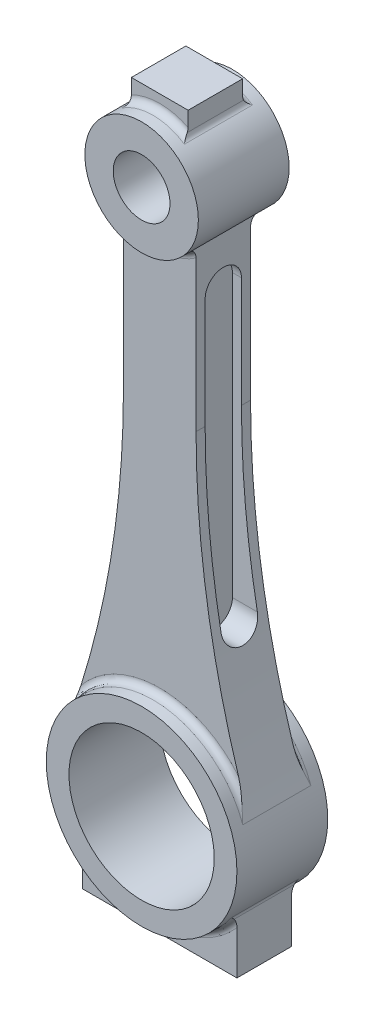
ISO-10303-21;
HEADER;
FILE_DESCRIPTION(('STEP AP214'),'2;1');
FILE_NAME('part.step','',(''),(''),'','','');
FILE_SCHEMA(('AUTOMOTIVE_DESIGN { 1 0 10303 214 1 1 1 1 }'));
ENDSEC;
DATA;
#1=APPLICATION_CONTEXT('core data for automotive mechanical design processes');
#2=APPLICATION_PROTOCOL_DEFINITION('international standard','automotive_design',2000,#1);
#3=PRODUCT_CONTEXT('',#1,'mechanical');
#4=PRODUCT('Part','Part','',(#3));
#5=PRODUCT_RELATED_PRODUCT_CATEGORY('part','',(#4));
#6=PRODUCT_DEFINITION_FORMATION('','',#4);
#7=PRODUCT_DEFINITION_CONTEXT('part definition',#1,'design');
#8=PRODUCT_DEFINITION('design','',#6,#7);
#9=PRODUCT_DEFINITION_SHAPE('','',#8);
#10=(LENGTH_UNIT() NAMED_UNIT(*) SI_UNIT(.MILLI.,.METRE.));
#11=(NAMED_UNIT(*) PLANE_ANGLE_UNIT() SI_UNIT($,.RADIAN.));
#12=(NAMED_UNIT(*) SI_UNIT($,.STERADIAN.) SOLID_ANGLE_UNIT());
#13=UNCERTAINTY_MEASURE_WITH_UNIT(LENGTH_MEASURE(1.E-05),#10,'distance_accuracy_value','');
#14=(GEOMETRIC_REPRESENTATION_CONTEXT(3) GLOBAL_UNCERTAINTY_ASSIGNED_CONTEXT((#13)) GLOBAL_UNIT_ASSIGNED_CONTEXT((#10,
#11,#12)) REPRESENTATION_CONTEXT('',''));
#15=CARTESIAN_POINT('',(0.,0.,0.));
#16=DIRECTION('',(0.,0.,1.));
#17=DIRECTION('',(1.,0.,0.));
#18=AXIS2_PLACEMENT_3D('',#15,#16,#17);
#19=CARTESIAN_POINT('',(212.132819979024,51.6917607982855,6.));
#20=DIRECTION('',(0.,0.,-1.));
#21=DIRECTION('',(-1.,0.,0.));
#22=AXIS2_PLACEMENT_3D('',#19,#20,#21);
#23=CYLINDRICAL_SURFACE('',#22,204.132819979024);
#24=CARTESIAN_POINT('',(212.132819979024,51.6917607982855,4.));
#25=DIRECTION('',(0.,0.,-1.));
#26=DIRECTION('',(0.,1.,0.));
#27=AXIS2_PLACEMENT_3D('',#24,#25,#26);
#28=CIRCLE('',#27,204.132819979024);
#29=CARTESIAN_POINT('',(8.00000000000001,51.6917607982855,4.));
#30=VERTEX_POINT('',#29);
#31=CARTESIAN_POINT('',(11.5031432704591,14.0362032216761,4.));
#32=VERTEX_POINT('',#31);
#33=EDGE_CURVE('E323',#30,#32,#28,.F.);
#34=ORIENTED_EDGE('',*,*,#33,.F.);
#35=DIRECTION('',(0.,0.,-1.));
#36=VECTOR('',#35,1.);
#37=CARTESIAN_POINT('',(8.00000000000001,51.6917607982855,6.));
#38=LINE('',#37,#36);
#39=CARTESIAN_POINT('',(8.00000000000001,51.6917607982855,6.));
#40=VERTEX_POINT('',#39);
#41=EDGE_CURVE('E414',#40,#30,#38,.T.);
#42=ORIENTED_EDGE('',*,*,#41,.F.);
#43=CARTESIAN_POINT('',(212.132819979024,51.6917607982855,6.));
#44=DIRECTION('',(0.,0.,-1.));
#45=DIRECTION('',(1.,0.,0.));
#46=AXIS2_PLACEMENT_3D('',#43,#44,#45);
#47=CIRCLE('',#46,204.132819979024);
#48=CARTESIAN_POINT('',(17.3484636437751,-9.37592885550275,6.));
#49=VERTEX_POINT('',#48);
#50=EDGE_CURVE('E380',#49,#40,#47,.T.);
#51=ORIENTED_EDGE('',*,*,#50,.F.);
#52=CARTESIAN_POINT('',(17.3484636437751,-9.37592885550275,6.));
#53=CARTESIAN_POINT('',(17.3862515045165,-9.49645922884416,6.00001500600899));
#54=CARTESIAN_POINT('',(17.4241463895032,-9.6169381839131,6.00226667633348));
#55=CARTESIAN_POINT('',(17.5001104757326,-9.8576705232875,6.0107765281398));
#56=CARTESIAN_POINT('',(17.5381796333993,-9.9779239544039,6.01703375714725));
#57=CARTESIAN_POINT('',(17.6144282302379,-10.2180067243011,6.03307945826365));
#58=CARTESIAN_POINT('',(17.6526075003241,-10.337836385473,6.04286400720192));
#59=CARTESIAN_POINT('',(17.7291014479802,-10.5771575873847,6.06559023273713));
#60=CARTESIAN_POINT('',(17.7674161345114,-10.6966491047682,6.07853212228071));
#61=CARTESIAN_POINT('',(17.8821972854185,-11.0534862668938,6.12145412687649));
#62=CARTESIAN_POINT('',(17.9588444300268,-11.290276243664,6.15560922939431));
#63=CARTESIAN_POINT('',(18.1125808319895,-11.7622905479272,6.2329122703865));
#64=CARTESIAN_POINT('',(18.1896702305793,-11.9975143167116,6.27606325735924));
#65=CARTESIAN_POINT('',(18.3902457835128,-12.6058142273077,6.39739156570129));
#66=CARTESIAN_POINT('',(18.5140560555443,-12.977667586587,6.4811364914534));
#67=CARTESIAN_POINT('',(18.7628531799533,-13.7178447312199,6.66123770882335));
#68=CARTESIAN_POINT('',(18.8878400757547,-14.086168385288,6.75759446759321));
#69=CARTESIAN_POINT('',(19.265270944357,-15.188140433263,7.05884892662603));
#70=CARTESIAN_POINT('',(19.5198396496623,-15.9177430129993,7.27569339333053));
#71=CARTESIAN_POINT('',(19.781450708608,-16.6541169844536,7.49502816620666));
#72=CARTESIAN_POINT('',(19.7844163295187,-16.6624627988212,7.49751409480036));
#73=CARTESIAN_POINT('',(19.7873824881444,-16.6708084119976,7.5));
#74=B_SPLINE_CURVE_WITH_KNOTS('',3,(#52,#53,#54,#55,#56,#57,#58,#59,#60,#61,#62,#63,#64,#65,#66,
#67,#68,#69,#70,#71,#72,#73),.UNSPECIFIED.,.F.,.F.,(4,2,2,2,2,2,2,2,2,2,4),(0.,
0.378900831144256,0.75771159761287,1.13610233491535,1.5145185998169,2.2679414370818,
3.02162000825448,4.22357731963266,5.42557916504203,7.83296233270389,7.86056027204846),.UNSPECIFIED.);
#75=CARTESIAN_POINT('',(19.7873824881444,-16.6708084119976,7.5));
#76=VERTEX_POINT('',#75);
#77=EDGE_CURVE('E498',#49,#76,#74,.T.);
#78=ORIENTED_EDGE('',*,*,#77,.T.);
#79=DIRECTION('',(0.,0.,-1.));
#80=VECTOR('',#79,1.);
#81=CARTESIAN_POINT('',(19.7873824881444,-16.6708084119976,6.));
#82=LINE('',#81,#80);
#83=CARTESIAN_POINT('',(19.7873824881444,-16.6708084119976,-7.5));
#84=VERTEX_POINT('',#83);
#85=EDGE_CURVE('E391',#76,#84,#82,.T.);
#86=ORIENTED_EDGE('',*,*,#85,.T.);
#87=CARTESIAN_POINT('',(17.3484636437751,-9.37592885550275,-6.));
#88=CARTESIAN_POINT('',(17.3862515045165,-9.49645922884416,-6.00001500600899));
#89=CARTESIAN_POINT('',(17.4241463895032,-9.6169381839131,-6.00226667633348));
#90=CARTESIAN_POINT('',(17.5001104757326,-9.8576705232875,-6.0107765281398));
#91=CARTESIAN_POINT('',(17.5381796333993,-9.97792395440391,-6.01703375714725));
#92=CARTESIAN_POINT('',(17.6144282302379,-10.2180067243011,-6.03307945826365));
#93=CARTESIAN_POINT('',(17.6526075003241,-10.337836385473,-6.04286400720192));
#94=CARTESIAN_POINT('',(17.7291014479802,-10.5771575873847,-6.06559023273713));
#95=CARTESIAN_POINT('',(17.7674161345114,-10.6966491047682,-6.07853212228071));
#96=CARTESIAN_POINT('',(17.8821972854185,-11.0534862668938,-6.12145412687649));
#97=CARTESIAN_POINT('',(17.9588444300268,-11.290276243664,-6.15560922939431));
#98=CARTESIAN_POINT('',(18.1125808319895,-11.7622905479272,-6.2329122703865));
#99=CARTESIAN_POINT('',(18.1896702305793,-11.9975143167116,-6.27606325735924));
#100=CARTESIAN_POINT('',(18.3902457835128,-12.6058142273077,-6.39739156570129));
#101=CARTESIAN_POINT('',(18.5140560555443,-12.977667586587,-6.4811364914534));
#102=CARTESIAN_POINT('',(18.7628531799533,-13.7178447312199,-6.66123770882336));
#103=CARTESIAN_POINT('',(18.8878400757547,-14.086168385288,-6.75759446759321));
#104=CARTESIAN_POINT('',(19.265270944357,-15.188140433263,-7.05884892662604));
#105=CARTESIAN_POINT('',(19.5198396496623,-15.9177430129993,-7.27569339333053));
#106=CARTESIAN_POINT('',(19.781450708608,-16.6541169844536,-7.49502816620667));
#107=CARTESIAN_POINT('',(19.7844163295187,-16.6624627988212,-7.49751409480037));
#108=CARTESIAN_POINT('',(19.7873824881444,-16.6708084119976,-7.5));
#109=B_SPLINE_CURVE_WITH_KNOTS('',3,(#87,#88,#89,#90,#91,#92,#93,#94,#95,#96,#97,#98,#99,#100,
#101,#102,#103,#104,#105,#106,#107,#108),.UNSPECIFIED.,.F.,.F.,(4,2,2,2,2,2,2,2,2,2,4),(0.,
0.378900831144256,0.757711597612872,1.13610233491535,1.5145185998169,2.2679414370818,
3.02162000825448,4.22357731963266,5.42557916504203,7.83296233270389,7.86056027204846),.UNSPECIFIED.);
#110=CARTESIAN_POINT('',(17.3484636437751,-9.37592885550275,-6.));
#111=VERTEX_POINT('',#110);
#112=EDGE_CURVE('E468',#84,#111,#109,.F.);
#113=ORIENTED_EDGE('',*,*,#112,.T.);
#114=CARTESIAN_POINT('',(212.132819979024,51.6917607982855,-6.));
#115=DIRECTION('',(0.,0.,-1.));
#116=DIRECTION('',(1.,0.,0.));
#117=AXIS2_PLACEMENT_3D('',#114,#115,#116);
#118=CIRCLE('',#117,204.132819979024);
#119=CARTESIAN_POINT('',(8.00000000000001,51.6917607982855,-6.));
#120=VERTEX_POINT('',#119);
#121=EDGE_CURVE('E377',#111,#120,#118,.T.);
#122=ORIENTED_EDGE('',*,*,#121,.T.);
#123=CARTESIAN_POINT('',(8.00000000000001,51.6917607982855,-3.99999999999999));
#124=VERTEX_POINT('',#123);
#125=EDGE_CURVE('E413',#124,#120,#38,.T.);
#126=ORIENTED_EDGE('',*,*,#125,.F.);
#127=CARTESIAN_POINT('',(212.132819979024,51.6917607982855,-3.99999999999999));
#128=DIRECTION('',(0.,0.,1.));
#129=DIRECTION('',(0.,-1.,0.));
#130=AXIS2_PLACEMENT_3D('',#127,#128,#129);
#131=CIRCLE('',#130,204.132819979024);
#132=CARTESIAN_POINT('',(11.5031432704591,14.0362032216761,-4.));
#133=VERTEX_POINT('',#132);
#134=EDGE_CURVE('E56',#133,#124,#131,.F.);
#135=ORIENTED_EDGE('',*,*,#134,.F.);
#136=CARTESIAN_POINT('',(11.5031432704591,14.0362032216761,4.));
#137=CARTESIAN_POINT('',(11.5245787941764,13.9219890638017,4.00000965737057));
#138=CARTESIAN_POINT('',(11.5461127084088,13.807798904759,3.99510816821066));
#139=CARTESIAN_POINT('',(11.5892201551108,13.580265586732,3.9755678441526));
#140=CARTESIAN_POINT('',(11.610793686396,13.4669224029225,3.96092929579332));
#141=CARTESIAN_POINT('',(11.6538188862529,13.2419044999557,3.92200485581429));
#142=CARTESIAN_POINT('',(11.6752705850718,13.1302293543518,3.89772147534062));
#143=CARTESIAN_POINT('',(11.7178878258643,12.9093441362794,3.83969347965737));
#144=CARTESIAN_POINT('',(11.739053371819,12.800134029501,3.80594899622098));
#145=CARTESIAN_POINT('',(11.8019005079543,12.477238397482,3.69076572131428));
#146=CARTESIAN_POINT('',(11.8429468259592,12.268213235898,3.59536419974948));
#147=CARTESIAN_POINT('',(11.9218849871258,11.8692646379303,3.37000277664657));
#148=CARTESIAN_POINT('',(11.9597777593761,11.6793355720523,3.24005310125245));
#149=CARTESIAN_POINT('',(12.030896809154,11.3251784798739,2.9499767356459));
#150=CARTESIAN_POINT('',(12.0641518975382,11.1607909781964,2.7900522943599));
#151=CARTESIAN_POINT('',(12.1250585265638,10.8612944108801,2.44383871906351));
#152=CARTESIAN_POINT('',(12.1527097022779,10.72618725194,2.25754786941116));
#153=CARTESIAN_POINT('',(12.2008852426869,10.4917148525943,1.86747180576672));
#154=CARTESIAN_POINT('',(12.2215289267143,10.3917500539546,1.66406183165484));
#155=CARTESIAN_POINT('',(12.255542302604,10.2274490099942,1.24277489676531));
#156=CARTESIAN_POINT('',(12.2689133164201,10.1631062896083,1.02490057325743));
#157=CARTESIAN_POINT('',(12.2876533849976,10.073018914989,0.585290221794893));
#158=CARTESIAN_POINT('',(12.2931689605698,10.0465674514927,0.363705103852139));
#159=CARTESIAN_POINT('',(12.2964467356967,10.030841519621,-0.0808351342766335));
#160=CARTESIAN_POINT('',(12.294209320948,10.0415652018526,-0.303790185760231));
#161=CARTESIAN_POINT('',(12.2821310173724,10.0995601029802,-0.742528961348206));
#162=CARTESIAN_POINT('',(12.2723619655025,10.1464860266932,-0.958360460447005));
#163=CARTESIAN_POINT('',(12.2456945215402,10.2749823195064,-1.37897696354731));
#164=CARTESIAN_POINT('',(12.2287960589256,10.356553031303,-1.58376185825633));
#165=CARTESIAN_POINT('',(12.1884103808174,10.5523483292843,-1.97772607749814));
#166=CARTESIAN_POINT('',(12.1648886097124,10.6667442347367,-2.1668166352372));
#167=CARTESIAN_POINT('',(12.1121660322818,10.9245748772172,-2.52312014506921));
#168=CARTESIAN_POINT('',(12.0829650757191,11.0680103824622,-2.69033251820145));
#169=CARTESIAN_POINT('',(12.0193793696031,11.3823925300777,-3.00116022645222));
#170=CARTESIAN_POINT('',(11.9849164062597,11.5537574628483,-3.14433632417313));
#171=CARTESIAN_POINT('',(11.9123316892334,11.9174148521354,-3.40002342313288));
#172=CARTESIAN_POINT('',(11.874208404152,12.1097160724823,-3.51252151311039));
#173=CARTESIAN_POINT('',(11.7947537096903,12.5138252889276,-3.70588207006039));
#174=CARTESIAN_POINT('',(11.7533736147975,12.7259449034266,-3.78607169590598));
#175=CARTESIAN_POINT('',(11.6694038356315,13.160271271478,-3.90941870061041));
#176=CARTESIAN_POINT('',(11.6268159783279,13.3824630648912,-3.95262922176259));
#177=CARTESIAN_POINT('',(11.5707210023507,13.6778422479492,-3.98456604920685));
#178=CARTESIAN_POINT('',(11.5571619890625,13.7494497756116,-3.9903565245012));
#179=CARTESIAN_POINT('',(11.5301054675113,13.8927607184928,-3.99806832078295));
#180=CARTESIAN_POINT('',(11.5166078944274,13.9644637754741,-3.99999606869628));
#181=CARTESIAN_POINT('',(11.5031432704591,14.0362032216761,-4.));
#182=B_SPLINE_CURVE_WITH_KNOTS('',3,(#136,#137,#138,#139,#140,#141,#142,#143,#144,#145,#146,
#147,#148,#149,#150,#151,#152,#153,#154,#155,#156,#157,#158,#159,#160,#161,#162,#163,#164,#165,
#166,#167,#168,#169,#170,#171,#172,#173,#174,#175,#176,#177,#178,#179,#180,#181),.UNSPECIFIED.,
.F.,.F.,(4,2,2,2,2,2,2,2,2,2,2,2,2,2,2,2,2,2,2,2,2,2,4),(0.,0.34851166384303,0.697013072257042,
1.04542380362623,1.39382968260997,2.09041403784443,2.78679243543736,3.47863108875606,
4.17051478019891,4.84994504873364,5.52925177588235,6.1957141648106,6.86214339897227,
7.52229367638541,8.18245048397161,8.84611744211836,9.50980195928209,10.1845366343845,
10.8595548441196,11.5479823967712,12.2354189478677,12.4546755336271,12.6735670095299),.UNSPECIFIED.);
#183=EDGE_CURVE('E596',#32,#133,#182,.T.);
#184=ORIENTED_EDGE('',*,*,#183,.F.);
#185=EDGE_LOOP('',(#34,#42,#51,#78,#86,#113,#122,#126,#135,#184));
#186=FACE_BOUND('',#185,.T.);
#187=ADVANCED_FACE('F32',(#186),#23,.F.);
#188=CARTESIAN_POINT('',(8.,86.6917607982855,6.));
#189=DIRECTION('',(-1.,0.,0.));
#190=DIRECTION('',(0.,-1.,0.));
#191=AXIS2_PLACEMENT_3D('',#188,#189,#190);
#192=PLANE('',#191);
#193=DIRECTION('',(0.,-1.,0.));
#194=VECTOR('',#193,1.);
#195=CARTESIAN_POINT('',(8.,86.6917607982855,4.00000000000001));
#196=LINE('',#195,#194);
#197=CARTESIAN_POINT('',(8.00000000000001,76.0362032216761,4.00000000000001));
#198=VERTEX_POINT('',#197);
#199=EDGE_CURVE('E601',#198,#30,#196,.T.);
#200=ORIENTED_EDGE('',*,*,#199,.F.);
#201=CARTESIAN_POINT('',(8.,76.0362032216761,0.));
#202=DIRECTION('',(-1.,0.,0.));
#203=DIRECTION('',(0.,-1.,0.));
#204=AXIS2_PLACEMENT_3D('',#201,#202,#203);
#205=CIRCLE('',#204,4.);
#206=CARTESIAN_POINT('',(8.00000000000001,76.0362032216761,-3.99999999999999));
#207=VERTEX_POINT('',#206);
#208=EDGE_CURVE('E603',#207,#198,#205,.F.);
#209=ORIENTED_EDGE('',*,*,#208,.F.);
#210=DIRECTION('',(0.,1.,0.));
#211=VECTOR('',#210,1.);
#212=CARTESIAN_POINT('',(8.,86.6917607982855,-3.99999999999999));
#213=LINE('',#212,#211);
#214=EDGE_CURVE('E605',#124,#207,#213,.T.);
#215=ORIENTED_EDGE('',*,*,#214,.F.);
#216=ORIENTED_EDGE('',*,*,#125,.T.);
#217=DIRECTION('',(0.,1.,0.));
#218=VECTOR('',#217,1.);
#219=CARTESIAN_POINT('',(8.,86.6917607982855,-6.));
#220=LINE('',#219,#218);
#221=CARTESIAN_POINT('',(8.,84.8073218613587,-6.));
#222=VERTEX_POINT('',#221);
#223=EDGE_CURVE('E394',#120,#222,#220,.T.);
#224=ORIENTED_EDGE('',*,*,#223,.T.);
#225=CARTESIAN_POINT('',(8.,84.8073218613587,-6.));
#226=CARTESIAN_POINT('',(8.,84.8707968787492,-6.00000852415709));
#227=CARTESIAN_POINT('',(8.,84.9342349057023,-6.00271419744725));
#228=CARTESIAN_POINT('',(8.,85.0606691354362,-6.01347127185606));
#229=CARTESIAN_POINT('',(8.,85.123665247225,-6.02152374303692));
#230=CARTESIAN_POINT('',(8.,85.3123303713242,-6.05378583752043));
#231=CARTESIAN_POINT('',(8.,85.4367213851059,-6.08609913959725));
#232=CARTESIAN_POINT('',(8.,85.676493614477,-6.1714437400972));
#233=CARTESIAN_POINT('',(8.,85.7919641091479,-6.22422506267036));
#234=CARTESIAN_POINT('',(8.,86.010720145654,-6.35050736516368));
#235=CARTESIAN_POINT('',(8.,86.1140509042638,-6.42392776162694));
#236=CARTESIAN_POINT('',(8.,86.2704523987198,-6.56280945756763));
#237=CARTESIAN_POINT('',(8.,86.3286729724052,-6.62250303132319));
#238=CARTESIAN_POINT('',(8.,86.4348084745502,-6.75049098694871));
#239=CARTESIAN_POINT('',(8.,86.4827345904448,-6.81877590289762));
#240=CARTESIAN_POINT('',(8.,86.5590441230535,-6.95163133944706));
#241=CARTESIAN_POINT('',(8.,86.5893101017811,-7.01511863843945));
#242=CARTESIAN_POINT('',(8.,86.6388036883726,-7.1462252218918));
#243=CARTESIAN_POINT('',(8.,86.6580522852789,-7.21383637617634));
#244=CARTESIAN_POINT('',(8.,86.6779767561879,-7.31837947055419));
#245=CARTESIAN_POINT('',(8.,86.6831325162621,-7.35450166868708));
#246=CARTESIAN_POINT('',(8.,86.6900280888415,-7.42707527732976));
#247=CARTESIAN_POINT('',(8.,86.6917673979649,-7.46352673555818));
#248=CARTESIAN_POINT('',(8.,86.6917607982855,-7.50000000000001));
#249=B_SPLINE_CURVE_WITH_KNOTS('',3,(#225,#226,#227,#228,#229,#230,#231,#232,#233,#234,#235,
#236,#237,#238,#239,#240,#241,#242,#243,#244,#245,#246,#247,#248),.UNSPECIFIED.,.F.,.F.,(4,2,2,
2,2,2,2,2,2,2,2,4),(0.,0.190295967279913,0.380630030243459,0.764126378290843,1.14307954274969,
1.52057319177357,1.76984121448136,2.01883696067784,2.22897683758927,2.43871503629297,
2.54803593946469,2.65737294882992),.UNSPECIFIED.);
#250=CARTESIAN_POINT('',(8.,86.6917607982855,-7.5));
#251=VERTEX_POINT('',#250);
#252=EDGE_CURVE('E539',#222,#251,#249,.T.);
#253=ORIENTED_EDGE('',*,*,#252,.T.);
#254=DIRECTION('',(0.,0.,-1.));
#255=VECTOR('',#254,1.);
#256=CARTESIAN_POINT('',(8.,86.6917607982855,6.));
#257=LINE('',#256,#255);
#258=CARTESIAN_POINT('',(8.,86.6917607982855,7.5));
#259=VERTEX_POINT('',#258);
#260=EDGE_CURVE('E411',#259,#251,#257,.T.);
#261=ORIENTED_EDGE('',*,*,#260,.F.);
#262=CARTESIAN_POINT('',(8.,86.6917607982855,7.5));
#263=CARTESIAN_POINT('',(8.,86.6917718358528,7.46439855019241));
#264=CARTESIAN_POINT('',(8.,86.6901116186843,7.42880298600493));
#265=CARTESIAN_POINT('',(8.,86.6835335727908,7.35793686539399));
#266=CARTESIAN_POINT('',(8.,86.6786178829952,7.32266611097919));
#267=CARTESIAN_POINT('',(8.,86.6656616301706,7.25297378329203));
#268=CARTESIAN_POINT('',(8.,86.6576444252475,7.21854786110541));
#269=CARTESIAN_POINT('',(8.,86.6386394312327,7.15053274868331));
#270=CARTESIAN_POINT('',(8.,86.6276512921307,7.11694365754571));
#271=CARTESIAN_POINT('',(8.,86.5905541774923,7.01792920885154));
#272=CARTESIAN_POINT('',(8.,86.5602680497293,6.95402650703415));
#273=CARTESIAN_POINT('',(8.,86.4902385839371,6.83158395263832));
#274=CARTESIAN_POINT('',(8.,86.4504755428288,6.77305562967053));
#275=CARTESIAN_POINT('',(8.,86.3483807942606,6.64323515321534));
#276=CARTESIAN_POINT('',(8.,86.2829706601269,6.57435893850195));
#277=CARTESIAN_POINT('',(8.,86.1418428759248,6.44819724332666));
#278=CARTESIAN_POINT('',(8.,86.0661134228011,6.39092522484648));
#279=CARTESIAN_POINT('',(8.,85.9059930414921,6.28732911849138));
#280=CARTESIAN_POINT('',(8.,85.8214923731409,6.24117595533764));
#281=CARTESIAN_POINT('',(8.,85.6470212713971,6.16086267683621));
#282=CARTESIAN_POINT('',(8.,85.5570504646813,6.12670338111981));
#283=CARTESIAN_POINT('',(8.,85.3588072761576,6.06586393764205));
#284=CARTESIAN_POINT('',(8.,85.2499014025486,6.04123994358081));
#285=CARTESIAN_POINT('',(8.,85.0297585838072,6.00833228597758));
#286=CARTESIAN_POINT('',(8.,84.9185241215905,6.00003203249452));
#287=CARTESIAN_POINT('',(8.,84.8073218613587,6.));
#288=B_SPLINE_CURVE_WITH_KNOTS('',3,(#262,#263,#264,#265,#266,#267,#268,#269,#270,#271,#272,
#273,#274,#275,#276,#277,#278,#279,#280,#281,#282,#283,#284,#285,#286,#287),.UNSPECIFIED.,.F.,
.F.,(4,2,2,2,2,2,2,2,2,2,2,2,4),(0.,0.106756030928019,0.213441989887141,0.319339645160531,
0.425249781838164,0.636375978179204,0.847945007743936,1.13136736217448,1.41511665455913,
1.70298342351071,1.99086986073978,2.32458340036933,2.65795760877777),.UNSPECIFIED.);
#289=CARTESIAN_POINT('',(8.,84.8073218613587,6.));
#290=VERTEX_POINT('',#289);
#291=EDGE_CURVE('E529',#259,#290,#288,.T.);
#292=ORIENTED_EDGE('',*,*,#291,.T.);
#293=DIRECTION('',(0.,1.,0.));
#294=VECTOR('',#293,1.);
#295=CARTESIAN_POINT('',(8.,86.6917607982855,6.));
#296=LINE('',#295,#294);
#297=EDGE_CURVE('E382',#40,#290,#296,.T.);
#298=ORIENTED_EDGE('',*,*,#297,.F.);
#299=ORIENTED_EDGE('',*,*,#41,.T.);
#300=EDGE_LOOP('',(#200,#209,#215,#216,#224,#253,#261,#292,#298,#299));
#301=FACE_BOUND('',#300,.T.);
#302=ADVANCED_FACE('F489',(#301),#192,.F.);
#303=CARTESIAN_POINT('',(0.,-23.7035528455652,10.));
#304=DIRECTION('',(0.,0.,1.));
#305=DIRECTION('',(1.,0.,0.));
#306=AXIS2_PLACEMENT_3D('',#303,#304,#305);
#307=PLANE('',#306);
#308=CARTESIAN_POINT('',(0.,-23.7035528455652,10.));
#309=DIRECTION('',(0.,0.,1.));
#310=DIRECTION('',(1.,0.,0.));
#311=AXIS2_PLACEMENT_3D('',#308,#309,#310);
#312=CIRCLE('',#311,21.);
#313=CARTESIAN_POINT('',(21.,-23.7035528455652,10.));
#314=VERTEX_POINT('',#313);
#315=EDGE_CURVE('E424',#314,#314,#312,.T.);
#316=ORIENTED_EDGE('',*,*,#315,.T.);
#317=EDGE_LOOP('',(#316));
#318=FACE_BOUND('',#317,.T.);
#319=CARTESIAN_POINT('',(0.,-23.7035528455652,10.));
#320=DIRECTION('',(0.,0.,1.));
#321=DIRECTION('',(1.,0.,0.));
#322=AXIS2_PLACEMENT_3D('',#319,#320,#321);
#323=CIRCLE('',#322,16.);
#324=CARTESIAN_POINT('',(16.,-23.7035528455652,10.));
#325=VERTEX_POINT('',#324);
#326=EDGE_CURVE('E418',#325,#325,#323,.T.);
#327=ORIENTED_EDGE('',*,*,#326,.F.);
#328=EDGE_LOOP('',(#327));
#329=FACE_BOUND('',#328,.T.);
#330=ADVANCED_FACE('F1010',(#318,#329),#307,.T.);
#331=CARTESIAN_POINT('',(0.,-23.7035528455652,-10.));
#332=DIRECTION('',(0.,0.,1.));
#333=DIRECTION('',(1.,0.,0.));
#334=AXIS2_PLACEMENT_3D('',#331,#332,#333);
#335=PLANE('',#334);
#336=CARTESIAN_POINT('',(0.,-23.7035528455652,-10.));
#337=DIRECTION('',(0.,0.,1.));
#338=DIRECTION('',(1.,0.,0.));
#339=AXIS2_PLACEMENT_3D('',#336,#337,#338);
#340=CIRCLE('',#339,21.);
#341=CARTESIAN_POINT('',(21.,-23.7035528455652,-10.));
#342=VERTEX_POINT('',#341);
#343=EDGE_CURVE('E421',#342,#342,#340,.T.);
#344=ORIENTED_EDGE('',*,*,#343,.F.);
#345=EDGE_LOOP('',(#344));
#346=FACE_BOUND('',#345,.T.);
#347=CARTESIAN_POINT('',(0.,-23.7035528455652,-10.));
#348=DIRECTION('',(0.,0.,1.));
#349=DIRECTION('',(1.,0.,0.));
#350=AXIS2_PLACEMENT_3D('',#347,#348,#349);
#351=CIRCLE('',#350,16.);
#352=CARTESIAN_POINT('',(16.,-23.7035528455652,-10.));
#353=VERTEX_POINT('',#352);
#354=EDGE_CURVE('E417',#353,#353,#351,.T.);
#355=ORIENTED_EDGE('',*,*,#354,.T.);
#356=EDGE_LOOP('',(#355));
#357=FACE_BOUND('',#356,.T.);
#358=ADVANCED_FACE('F1076',(#346,#357),#335,.F.);
#359=CARTESIAN_POINT('',(0.,-23.7035528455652,10.));
#360=DIRECTION('',(0.,0.,-1.));
#361=DIRECTION('',(-1.,0.,0.));
#362=AXIS2_PLACEMENT_3D('',#359,#360,#361);
#363=CYLINDRICAL_SURFACE('',#362,21.);
#364=DIRECTION('',(0.,0.,-1.));
#365=VECTOR('',#364,1.);
#366=CARTESIAN_POINT('',(-17.2666666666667,-35.6560514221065,10.));
#367=LINE('',#366,#365);
#368=CARTESIAN_POINT('',(-17.2666666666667,-35.6560514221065,-7.5));
#369=VERTEX_POINT('',#368);
#370=CARTESIAN_POINT('',(-17.2666666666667,-35.6560514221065,7.5));
#371=VERTEX_POINT('',#370);
#372=EDGE_CURVE('E781',#369,#371,#367,.F.);
#373=ORIENTED_EDGE('',*,*,#372,.T.);
#374=CARTESIAN_POINT('',(0.,-23.7035528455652,7.5));
#375=DIRECTION('',(0.,0.,1.));
#376=DIRECTION('',(1.,0.,0.));
#377=AXIS2_PLACEMENT_3D('',#374,#375,#376);
#378=CIRCLE('',#377,21.);
#379=CARTESIAN_POINT('',(17.2666666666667,-35.6560514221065,7.5));
#380=VERTEX_POINT('',#379);
#381=EDGE_CURVE('E784',#371,#380,#378,.T.);
#382=ORIENTED_EDGE('',*,*,#381,.T.);
#383=DIRECTION('',(0.,0.,-1.));
#384=VECTOR('',#383,1.);
#385=CARTESIAN_POINT('',(17.2666666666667,-35.6560514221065,10.));
#386=LINE('',#385,#384);
#387=CARTESIAN_POINT('',(17.2666666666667,-35.6560514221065,-7.5));
#388=VERTEX_POINT('',#387);
#389=EDGE_CURVE('E769',#380,#388,#386,.T.);
#390=ORIENTED_EDGE('',*,*,#389,.T.);
#391=CARTESIAN_POINT('',(0.,-23.7035528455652,-7.5));
#392=DIRECTION('',(0.,0.,1.));
#393=DIRECTION('',(1.,0.,0.));
#394=AXIS2_PLACEMENT_3D('',#391,#392,#393);
#395=CIRCLE('',#394,21.);
#396=EDGE_CURVE('E776',#388,#369,#395,.F.);
#397=ORIENTED_EDGE('',*,*,#396,.T.);
#398=EDGE_LOOP('',(#373,#382,#390,#397));
#399=FACE_BOUND('',#398,.T.);
#400=CARTESIAN_POINT('',(0.,-23.7035528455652,-7.5));
#401=DIRECTION('',(0.,0.,1.));
#402=DIRECTION('',(1.,0.,0.));
#403=AXIS2_PLACEMENT_3D('',#400,#401,#402);
#404=CIRCLE('',#403,21.);
#405=CARTESIAN_POINT('',(-19.7873824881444,-16.6708084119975,-7.5));
#406=VERTEX_POINT('',#405);
#407=EDGE_CURVE('E432',#406,#84,#404,.F.);
#408=ORIENTED_EDGE('',*,*,#407,.T.);
#409=ORIENTED_EDGE('',*,*,#85,.F.);
#410=CARTESIAN_POINT('',(0.,-23.7035528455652,7.5));
#411=DIRECTION('',(0.,0.,1.));
#412=DIRECTION('',(1.,0.,0.));
#413=AXIS2_PLACEMENT_3D('',#410,#411,#412);
#414=CIRCLE('',#413,21.);
#415=CARTESIAN_POINT('',(-19.7873824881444,-16.6708084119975,7.5));
#416=VERTEX_POINT('',#415);
#417=EDGE_CURVE('E427',#76,#416,#414,.T.);
#418=ORIENTED_EDGE('',*,*,#417,.T.);
#419=DIRECTION('',(0.,0.,-1.));
#420=VECTOR('',#419,1.);
#421=CARTESIAN_POINT('',(-19.7873824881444,-16.6708084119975,6.));
#422=LINE('',#421,#420);
#423=EDGE_CURVE('E403',#416,#406,#422,.T.);
#424=ORIENTED_EDGE('',*,*,#423,.T.);
#425=EDGE_LOOP('',(#408,#409,#418,#424));
#426=FACE_BOUND('',#425,.T.);
#427=ORIENTED_EDGE('',*,*,#315,.F.);
#428=EDGE_LOOP('',(#427));
#429=FACE_BOUND('',#428,.T.);
#430=ORIENTED_EDGE('',*,*,#343,.T.);
#431=EDGE_LOOP('',(#430));
#432=FACE_BOUND('',#431,.T.);
#433=ADVANCED_FACE('F782',(#399,#426,#429,#432),#363,.T.);
#434=CARTESIAN_POINT('',(0.,-23.7035528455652,10.));
#435=DIRECTION('',(0.,0.,-1.));
#436=DIRECTION('',(-1.,0.,0.));
#437=AXIS2_PLACEMENT_3D('',#434,#435,#436);
#438=CYLINDRICAL_SURFACE('',#437,16.);
#439=ORIENTED_EDGE('',*,*,#326,.T.);
#440=EDGE_LOOP('',(#439));
#441=FACE_BOUND('',#440,.T.);
#442=ORIENTED_EDGE('',*,*,#354,.F.);
#443=EDGE_LOOP('',(#442));
#444=FACE_BOUND('',#443,.T.);
#445=ADVANCED_FACE('F493',(#441,#444),#438,.F.);
#446=CARTESIAN_POINT('',(-8.,86.6917607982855,6.));
#447=DIRECTION('',(1.,0.,0.));
#448=DIRECTION('',(0.,1.,0.));
#449=AXIS2_PLACEMENT_3D('',#446,#447,#448);
#450=PLANE('',#449);
#451=DIRECTION('',(0.,0.,-1.));
#452=VECTOR('',#451,1.);
#453=CARTESIAN_POINT('',(-8.,51.6917607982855,6.));
#454=LINE('',#453,#452);
#455=CARTESIAN_POINT('',(-8.00000000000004,51.6917607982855,-3.99999999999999));
#456=VERTEX_POINT('',#455);
#457=CARTESIAN_POINT('',(-8.,51.6917607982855,-6.));
#458=VERTEX_POINT('',#457);
#459=EDGE_CURVE('E405',#456,#458,#454,.T.);
#460=ORIENTED_EDGE('',*,*,#459,.F.);
#461=DIRECTION('',(0.,1.,0.));
#462=VECTOR('',#461,1.);
#463=CARTESIAN_POINT('',(-8.,86.6917607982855,-3.99999999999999));
#464=LINE('',#463,#462);
#465=CARTESIAN_POINT('',(-7.99999999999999,76.0362032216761,-3.99999999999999));
#466=VERTEX_POINT('',#465);
#467=EDGE_CURVE('E300',#456,#466,#464,.T.);
#468=ORIENTED_EDGE('',*,*,#467,.T.);
#469=CARTESIAN_POINT('',(-8.,76.0362032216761,0.));
#470=DIRECTION('',(1.,0.,0.));
#471=DIRECTION('',(0.,1.,0.));
#472=AXIS2_PLACEMENT_3D('',#469,#470,#471);
#473=CIRCLE('',#472,4.);
#474=CARTESIAN_POINT('',(-7.99999999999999,76.0362032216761,4.00000000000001));
#475=VERTEX_POINT('',#474);
#476=EDGE_CURVE('E11',#466,#475,#473,.T.);
#477=ORIENTED_EDGE('',*,*,#476,.T.);
#478=DIRECTION('',(0.,-1.,0.));
#479=VECTOR('',#478,1.);
#480=CARTESIAN_POINT('',(-8.,86.6917607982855,4.00000000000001));
#481=LINE('',#480,#479);
#482=CARTESIAN_POINT('',(-8.00000000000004,51.6917607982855,4.));
#483=VERTEX_POINT('',#482);
#484=EDGE_CURVE('E276',#475,#483,#481,.T.);
#485=ORIENTED_EDGE('',*,*,#484,.T.);
#486=CARTESIAN_POINT('',(-8.,51.6917607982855,6.));
#487=VERTEX_POINT('',#486);
#488=EDGE_CURVE('E406',#487,#483,#454,.T.);
#489=ORIENTED_EDGE('',*,*,#488,.F.);
#490=DIRECTION('',(0.,-1.,0.));
#491=VECTOR('',#490,1.);
#492=CARTESIAN_POINT('',(-8.,86.6917607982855,6.));
#493=LINE('',#492,#491);
#494=CARTESIAN_POINT('',(-8.,84.8073218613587,6.));
#495=VERTEX_POINT('',#494);
#496=EDGE_CURVE('E386',#495,#487,#493,.T.);
#497=ORIENTED_EDGE('',*,*,#496,.F.);
#498=CARTESIAN_POINT('',(-8.,84.8073218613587,6.));
#499=CARTESIAN_POINT('',(-8.,84.8707968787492,6.00000852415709));
#500=CARTESIAN_POINT('',(-8.,84.9342349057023,6.00271419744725));
#501=CARTESIAN_POINT('',(-8.,85.0606691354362,6.01347127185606));
#502=CARTESIAN_POINT('',(-8.,85.123665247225,6.02152374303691));
#503=CARTESIAN_POINT('',(-8.,85.3123303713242,6.05378583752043));
#504=CARTESIAN_POINT('',(-8.,85.4367213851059,6.08609913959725));
#505=CARTESIAN_POINT('',(-8.,85.676493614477,6.1714437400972));
#506=CARTESIAN_POINT('',(-8.,85.7919641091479,6.22422506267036));
#507=CARTESIAN_POINT('',(-8.,86.010720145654,6.35050736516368));
#508=CARTESIAN_POINT('',(-8.,86.1140509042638,6.42392776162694));
#509=CARTESIAN_POINT('',(-8.,86.2704523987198,6.56280945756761));
#510=CARTESIAN_POINT('',(-8.,86.3286729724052,6.62250303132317));
#511=CARTESIAN_POINT('',(-8.,86.4348084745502,6.75049098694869));
#512=CARTESIAN_POINT('',(-8.,86.4827345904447,6.8187759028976));
#513=CARTESIAN_POINT('',(-8.,86.5590441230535,6.95163133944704));
#514=CARTESIAN_POINT('',(-8.,86.5893101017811,7.01511863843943));
#515=CARTESIAN_POINT('',(-8.,86.6388036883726,7.14622522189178));
#516=CARTESIAN_POINT('',(-8.,86.6580522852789,7.21383637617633));
#517=CARTESIAN_POINT('',(-8.,86.6779767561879,7.31837947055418));
#518=CARTESIAN_POINT('',(-8.,86.6831325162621,7.35450166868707));
#519=CARTESIAN_POINT('',(-8.,86.6900280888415,7.42707527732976));
#520=CARTESIAN_POINT('',(-8.,86.6917673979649,7.46352673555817));
#521=CARTESIAN_POINT('',(-8.,86.6917607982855,7.50000000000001));
#522=B_SPLINE_CURVE_WITH_KNOTS('',3,(#498,#499,#500,#501,#502,#503,#504,#505,#506,#507,#508,
#509,#510,#511,#512,#513,#514,#515,#516,#517,#518,#519,#520,#521),.UNSPECIFIED.,.F.,.F.,(4,2,2,
2,2,2,2,2,2,2,2,4),(0.,0.190295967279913,0.380630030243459,0.764126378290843,1.14307954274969,
1.52057319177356,1.76984121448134,2.01883696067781,2.22897683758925,2.43871503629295,
2.54803593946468,2.65737294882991),.UNSPECIFIED.);
#523=CARTESIAN_POINT('',(-8.00000000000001,86.6917607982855,7.5));
#524=VERTEX_POINT('',#523);
#525=EDGE_CURVE('E524',#495,#524,#522,.T.);
#526=ORIENTED_EDGE('',*,*,#525,.T.);
#527=DIRECTION('',(0.,0.,-1.));
#528=VECTOR('',#527,1.);
#529=CARTESIAN_POINT('',(-8.,86.6917607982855,6.));
#530=LINE('',#529,#528);
#531=CARTESIAN_POINT('',(-8.00000000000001,86.6917607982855,-7.5));
#532=VERTEX_POINT('',#531);
#533=EDGE_CURVE('E409',#524,#532,#530,.T.);
#534=ORIENTED_EDGE('',*,*,#533,.T.);
#535=CARTESIAN_POINT('',(-8.00000000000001,86.6917607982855,-7.5));
#536=CARTESIAN_POINT('',(-8.,86.6917718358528,-7.46439855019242));
#537=CARTESIAN_POINT('',(-8.,86.6901116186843,-7.42880298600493));
#538=CARTESIAN_POINT('',(-8.,86.6835335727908,-7.35793686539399));
#539=CARTESIAN_POINT('',(-8.,86.6786178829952,-7.32266611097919));
#540=CARTESIAN_POINT('',(-8.,86.6656616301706,-7.25297378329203));
#541=CARTESIAN_POINT('',(-8.,86.6576444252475,-7.21854786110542));
#542=CARTESIAN_POINT('',(-8.,86.6386394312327,-7.15053274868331));
#543=CARTESIAN_POINT('',(-8.,86.6276512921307,-7.11694365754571));
#544=CARTESIAN_POINT('',(-8.,86.5905541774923,-7.01792920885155));
#545=CARTESIAN_POINT('',(-8.,86.5602680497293,-6.95402650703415));
#546=CARTESIAN_POINT('',(-8.,86.4902385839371,-6.83158395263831));
#547=CARTESIAN_POINT('',(-8.,86.4504755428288,-6.77305562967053));
#548=CARTESIAN_POINT('',(-8.,86.3483807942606,-6.64323515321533));
#549=CARTESIAN_POINT('',(-8.,86.2829706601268,-6.57435893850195));
#550=CARTESIAN_POINT('',(-8.,86.1418428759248,-6.44819724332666));
#551=CARTESIAN_POINT('',(-8.,86.0661134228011,-6.39092522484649));
#552=CARTESIAN_POINT('',(-8.,85.9059930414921,-6.28732911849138));
#553=CARTESIAN_POINT('',(-8.,85.8214923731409,-6.24117595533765));
#554=CARTESIAN_POINT('',(-8.,85.6470212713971,-6.16086267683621));
#555=CARTESIAN_POINT('',(-8.,85.5570504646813,-6.12670338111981));
#556=CARTESIAN_POINT('',(-8.,85.3588072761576,-6.06586393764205));
#557=CARTESIAN_POINT('',(-8.,85.2499014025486,-6.04123994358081));
#558=CARTESIAN_POINT('',(-8.,85.0297585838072,-6.00833228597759));
#559=CARTESIAN_POINT('',(-8.,84.9185241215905,-6.00003203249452));
#560=CARTESIAN_POINT('',(-8.,84.8073218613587,-6.));
#561=B_SPLINE_CURVE_WITH_KNOTS('',3,(#535,#536,#537,#538,#539,#540,#541,#542,#543,#544,#545,
#546,#547,#548,#549,#550,#551,#552,#553,#554,#555,#556,#557,#558,#559,#560),.UNSPECIFIED.,.F.,
.F.,(4,2,2,2,2,2,2,2,2,2,2,2,4),(0.,0.106756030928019,0.213441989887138,0.31933964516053,
0.425249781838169,0.636375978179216,0.847945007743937,1.13136736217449,1.41511665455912,
1.70298342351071,1.99086986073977,2.32458340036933,2.65795760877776),.UNSPECIFIED.);
#562=CARTESIAN_POINT('',(-8.,84.8073218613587,-6.));
#563=VERTEX_POINT('',#562);
#564=EDGE_CURVE('E534',#532,#563,#561,.T.);
#565=ORIENTED_EDGE('',*,*,#564,.T.);
#566=DIRECTION('',(0.,-1.,0.));
#567=VECTOR('',#566,1.);
#568=CARTESIAN_POINT('',(-8.,86.6917607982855,-6.));
#569=LINE('',#568,#567);
#570=EDGE_CURVE('E397',#563,#458,#569,.T.);
#571=ORIENTED_EDGE('',*,*,#570,.T.);
#572=EDGE_LOOP('',(#460,#468,#477,#485,#489,#497,#526,#534,#565,#571));
#573=FACE_BOUND('',#572,.T.);
#574=ADVANCED_FACE('F544',(#573),#450,.F.);
#575=CARTESIAN_POINT('',(-212.132819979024,51.6917607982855,6.));
#576=DIRECTION('',(0.,0.,-1.));
#577=DIRECTION('',(-1.,0.,0.));
#578=AXIS2_PLACEMENT_3D('',#575,#576,#577);
#579=CYLINDRICAL_SURFACE('',#578,204.132819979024);
#580=CARTESIAN_POINT('',(-11.5031432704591,14.0362032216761,4.));
#581=CARTESIAN_POINT('',(-11.5245787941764,13.9219890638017,4.00000965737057));
#582=CARTESIAN_POINT('',(-11.5461127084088,13.807798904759,3.99510816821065));
#583=CARTESIAN_POINT('',(-11.5892201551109,13.580265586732,3.97556784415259));
#584=CARTESIAN_POINT('',(-11.610793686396,13.4669224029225,3.96092929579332));
#585=CARTESIAN_POINT('',(-11.6538188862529,13.2419044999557,3.92200485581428));
#586=CARTESIAN_POINT('',(-11.6752705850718,13.1302293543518,3.89772147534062));
#587=CARTESIAN_POINT('',(-11.7178878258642,12.9093441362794,3.83969347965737));
#588=CARTESIAN_POINT('',(-11.739053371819,12.800134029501,3.80594899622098));
#589=CARTESIAN_POINT('',(-11.8019005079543,12.477238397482,3.69076572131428));
#590=CARTESIAN_POINT('',(-11.8429468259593,12.268213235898,3.59536419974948));
#591=CARTESIAN_POINT('',(-11.9218849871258,11.8692646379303,3.37000277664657));
#592=CARTESIAN_POINT('',(-11.9597777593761,11.6793355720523,3.24005310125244));
#593=CARTESIAN_POINT('',(-12.030896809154,11.3251784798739,2.94997673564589));
#594=CARTESIAN_POINT('',(-12.0641518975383,11.1607909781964,2.7900522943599));
#595=CARTESIAN_POINT('',(-12.1250585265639,10.8612944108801,2.44383871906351));
#596=CARTESIAN_POINT('',(-12.1527097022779,10.72618725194,2.25754786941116));
#597=CARTESIAN_POINT('',(-12.2008852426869,10.4917148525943,1.86747180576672));
#598=CARTESIAN_POINT('',(-12.2215289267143,10.3917500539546,1.66406183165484));
#599=CARTESIAN_POINT('',(-12.255542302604,10.2274490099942,1.24277489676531));
#600=CARTESIAN_POINT('',(-12.2689133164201,10.1631062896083,1.02490057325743));
#601=CARTESIAN_POINT('',(-12.2876533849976,10.073018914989,0.585290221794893));
#602=CARTESIAN_POINT('',(-12.2931689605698,10.0465674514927,0.363705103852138));
#603=CARTESIAN_POINT('',(-12.2964467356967,10.030841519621,-0.0808351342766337));
#604=CARTESIAN_POINT('',(-12.294209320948,10.0415652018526,-0.303790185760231));
#605=CARTESIAN_POINT('',(-12.2821310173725,10.0995601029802,-0.742528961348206));
#606=CARTESIAN_POINT('',(-12.2723619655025,10.1464860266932,-0.958360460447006));
#607=CARTESIAN_POINT('',(-12.2456945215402,10.2749823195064,-1.37897696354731));
#608=CARTESIAN_POINT('',(-12.2287960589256,10.356553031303,-1.58376185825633));
#609=CARTESIAN_POINT('',(-12.1884103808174,10.5523483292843,-1.97772607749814));
#610=CARTESIAN_POINT('',(-12.1648886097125,10.6667442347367,-2.1668166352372));
#611=CARTESIAN_POINT('',(-12.1121660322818,10.9245748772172,-2.52312014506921));
#612=CARTESIAN_POINT('',(-12.0829650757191,11.0680103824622,-2.69033251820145));
#613=CARTESIAN_POINT('',(-12.0193793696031,11.3823925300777,-3.00116022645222));
#614=CARTESIAN_POINT('',(-11.9849164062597,11.5537574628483,-3.14433632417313));
#615=CARTESIAN_POINT('',(-11.9123316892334,11.9174148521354,-3.40002342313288));
#616=CARTESIAN_POINT('',(-11.874208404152,12.1097160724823,-3.51252151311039));
#617=CARTESIAN_POINT('',(-11.7947537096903,12.5138252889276,-3.7058820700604));
#618=CARTESIAN_POINT('',(-11.7533736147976,12.7259449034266,-3.78607169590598));
#619=CARTESIAN_POINT('',(-11.6694038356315,13.160271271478,-3.90941870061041));
#620=CARTESIAN_POINT('',(-11.6268159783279,13.3824630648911,-3.95262922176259));
#621=CARTESIAN_POINT('',(-11.5707210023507,13.6778422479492,-3.98456604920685));
#622=CARTESIAN_POINT('',(-11.5571619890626,13.7494497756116,-3.9903565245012));
#623=CARTESIAN_POINT('',(-11.5301054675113,13.8927607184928,-3.99806832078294));
#624=CARTESIAN_POINT('',(-11.5166078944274,13.9644637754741,-3.99999606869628));
#625=CARTESIAN_POINT('',(-11.5031432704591,14.0362032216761,-4.));
#626=B_SPLINE_CURVE_WITH_KNOTS('',3,(#580,#581,#582,#583,#584,#585,#586,#587,#588,#589,#590,
#591,#592,#593,#594,#595,#596,#597,#598,#599,#600,#601,#602,#603,#604,#605,#606,#607,#608,#609,
#610,#611,#612,#613,#614,#615,#616,#617,#618,#619,#620,#621,#622,#623,#624,#625),.UNSPECIFIED.,
.F.,.F.,(4,2,2,2,2,2,2,2,2,2,2,2,2,2,2,2,2,2,2,2,2,2,4),(0.,0.348511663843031,0.697013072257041,
1.04542380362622,1.39382968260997,2.09041403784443,2.78679243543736,3.47863108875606,
4.17051478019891,4.84994504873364,5.52925177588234,6.19571416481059,6.86214339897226,
7.5222936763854,8.1824504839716,8.84611744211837,9.50980195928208,10.1845366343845,
10.8595548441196,11.5479823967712,12.2354189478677,12.4546755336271,12.6735670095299),.UNSPECIFIED.);
#627=CARTESIAN_POINT('',(-11.5031432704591,14.0362032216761,4.));
#628=VERTEX_POINT('',#627);
#629=CARTESIAN_POINT('',(-11.5031432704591,14.0362032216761,-4.));
#630=VERTEX_POINT('',#629);
#631=EDGE_CURVE('E560',#628,#630,#626,.T.);
#632=ORIENTED_EDGE('',*,*,#631,.T.);
#633=CARTESIAN_POINT('',(-212.132819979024,51.6917607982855,-3.99999999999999));
#634=DIRECTION('',(0.,0.,-1.));
#635=DIRECTION('',(0.,1.,0.));
#636=AXIS2_PLACEMENT_3D('',#633,#634,#635);
#637=CIRCLE('',#636,204.132819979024);
#638=EDGE_CURVE('E41',#630,#456,#637,.F.);
#639=ORIENTED_EDGE('',*,*,#638,.T.);
#640=ORIENTED_EDGE('',*,*,#459,.T.);
#641=CARTESIAN_POINT('',(-212.132819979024,51.6917607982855,-6.));
#642=DIRECTION('',(0.,0.,-1.));
#643=DIRECTION('',(-1.,0.,0.));
#644=AXIS2_PLACEMENT_3D('',#641,#642,#643);
#645=CIRCLE('',#644,204.132819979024);
#646=CARTESIAN_POINT('',(-17.3484636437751,-9.37592885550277,-6.));
#647=VERTEX_POINT('',#646);
#648=EDGE_CURVE('E383',#458,#647,#645,.T.);
#649=ORIENTED_EDGE('',*,*,#648,.T.);
#650=CARTESIAN_POINT('',(-17.3484636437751,-9.37592885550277,-6.));
#651=CARTESIAN_POINT('',(-17.3862515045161,-9.49645922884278,-6.00001500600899));
#652=CARTESIAN_POINT('',(-17.4241463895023,-9.61693818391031,-6.00226667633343));
#653=CARTESIAN_POINT('',(-17.5001104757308,-9.85767052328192,-6.01077652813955));
#654=CARTESIAN_POINT('',(-17.5381796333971,-9.97792395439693,-6.01703375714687));
#655=CARTESIAN_POINT('',(-17.6144282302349,-10.2180067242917,-6.03307945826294));
#656=CARTESIAN_POINT('',(-17.6526075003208,-10.3378363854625,-6.04286400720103));
#657=CARTESIAN_POINT('',(-17.7291014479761,-10.577157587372,-6.06559023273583));
#658=CARTESIAN_POINT('',(-17.7674161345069,-10.6966491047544,-6.07853212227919));
#659=CARTESIAN_POINT('',(-17.8821972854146,-11.0534862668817,-6.12145412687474));
#660=CARTESIAN_POINT('',(-17.9588444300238,-11.2902762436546,-6.15560922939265));
#661=CARTESIAN_POINT('',(-18.112580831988,-11.7622905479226,-6.23291227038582));
#662=CARTESIAN_POINT('',(-18.1896702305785,-11.9975143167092,-6.27606325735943));
#663=CARTESIAN_POINT('',(-18.390245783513,-12.6058142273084,-6.39739156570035));
#664=CARTESIAN_POINT('',(-18.514056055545,-12.977667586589,-6.48113649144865));
#665=CARTESIAN_POINT('',(-18.7628531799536,-13.7178447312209,-6.66123770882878));
#666=CARTESIAN_POINT('',(-18.887840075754,-14.0861683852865,-6.75759446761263));
#667=CARTESIAN_POINT('',(-19.2652709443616,-15.1881404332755,-7.05884892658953));
#668=CARTESIAN_POINT('',(-19.5198396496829,-15.917743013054,-7.27569339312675));
#669=CARTESIAN_POINT('',(-19.7814507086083,-16.6541169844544,-7.49502816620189));
#670=CARTESIAN_POINT('',(-19.7844163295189,-16.6624627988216,-7.49751409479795));
#671=CARTESIAN_POINT('',(-19.7873824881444,-16.6708084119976,-7.5));
#672=B_SPLINE_CURVE_WITH_KNOTS('',3,(#650,#651,#652,#653,#654,#655,#656,#657,#658,#659,#660,
#661,#662,#663,#664,#665,#666,#667,#668,#669,#670,#671),.UNSPECIFIED.,.F.,.F.,(4,2,2,2,2,2,2,2,
2,2,4),(0.,0.378900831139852,0.757711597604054,1.13610233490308,1.51451859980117,
2.26794143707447,3.02162000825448,4.22357731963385,5.42557916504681,7.83296233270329,
7.86056027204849),.UNSPECIFIED.);
#673=EDGE_CURVE('E475',#647,#406,#672,.T.);
#674=ORIENTED_EDGE('',*,*,#673,.T.);
#675=ORIENTED_EDGE('',*,*,#423,.F.);
#676=CARTESIAN_POINT('',(-17.3484636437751,-9.37592885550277,6.));
#677=CARTESIAN_POINT('',(-17.3862515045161,-9.49645922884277,6.00001500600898));
#678=CARTESIAN_POINT('',(-17.4241463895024,-9.6169381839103,6.00226667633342));
#679=CARTESIAN_POINT('',(-17.5001104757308,-9.85767052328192,6.01077652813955));
#680=CARTESIAN_POINT('',(-17.5381796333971,-9.97792395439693,6.01703375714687));
#681=CARTESIAN_POINT('',(-17.6144282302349,-10.2180067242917,6.03307945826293));
#682=CARTESIAN_POINT('',(-17.6526075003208,-10.3378363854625,6.04286400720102));
#683=CARTESIAN_POINT('',(-17.7291014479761,-10.577157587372,6.06559023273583));
#684=CARTESIAN_POINT('',(-17.7674161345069,-10.6966491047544,6.07853212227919));
#685=CARTESIAN_POINT('',(-17.8821972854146,-11.0534862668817,6.12145412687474));
#686=CARTESIAN_POINT('',(-17.9588444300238,-11.2902762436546,6.15560922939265));
#687=CARTESIAN_POINT('',(-18.112580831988,-11.7622905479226,6.23291227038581));
#688=CARTESIAN_POINT('',(-18.1896702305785,-11.9975143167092,6.27606325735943));
#689=CARTESIAN_POINT('',(-18.390245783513,-12.6058142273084,6.39739156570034));
#690=CARTESIAN_POINT('',(-18.514056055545,-12.977667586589,6.48113649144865));
#691=CARTESIAN_POINT('',(-18.7628531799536,-13.7178447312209,6.66123770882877));
#692=CARTESIAN_POINT('',(-18.887840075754,-14.0861683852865,6.75759446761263));
#693=CARTESIAN_POINT('',(-19.2652709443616,-15.1881404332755,7.05884892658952));
#694=CARTESIAN_POINT('',(-19.5198396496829,-15.917743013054,7.2756933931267));
#695=CARTESIAN_POINT('',(-19.7814507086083,-16.6541169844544,7.49502816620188));
#696=CARTESIAN_POINT('',(-19.7844163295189,-16.6624627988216,7.49751409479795));
#697=CARTESIAN_POINT('',(-19.7873824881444,-16.6708084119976,7.5));
#698=B_SPLINE_CURVE_WITH_KNOTS('',3,(#676,#677,#678,#679,#680,#681,#682,#683,#684,#685,#686,
#687,#688,#689,#690,#691,#692,#693,#694,#695,#696,#697),.UNSPECIFIED.,.F.,.F.,(4,2,2,2,2,2,2,2,
2,2,4),(0.,0.378900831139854,0.757711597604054,1.13610233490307,1.51451859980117,
2.26794143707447,3.02162000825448,4.22357731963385,5.42557916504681,7.83296233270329,
7.86056027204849),.UNSPECIFIED.);
#699=CARTESIAN_POINT('',(-17.3484636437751,-9.37592885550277,6.));
#700=VERTEX_POINT('',#699);
#701=EDGE_CURVE('E504',#416,#700,#698,.F.);
#702=ORIENTED_EDGE('',*,*,#701,.T.);
#703=CARTESIAN_POINT('',(-212.132819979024,51.6917607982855,6.));
#704=DIRECTION('',(0.,0.,-1.));
#705=DIRECTION('',(-1.,0.,0.));
#706=AXIS2_PLACEMENT_3D('',#703,#704,#705);
#707=CIRCLE('',#706,204.132819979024);
#708=EDGE_CURVE('E388',#487,#700,#707,.T.);
#709=ORIENTED_EDGE('',*,*,#708,.F.);
#710=ORIENTED_EDGE('',*,*,#488,.T.);
#711=CARTESIAN_POINT('',(-212.132819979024,51.6917607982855,4.));
#712=DIRECTION('',(0.,0.,1.));
#713=DIRECTION('',(0.,-1.,0.));
#714=AXIS2_PLACEMENT_3D('',#711,#712,#713);
#715=CIRCLE('',#714,204.132819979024);
#716=EDGE_CURVE('E567',#483,#628,#715,.F.);
#717=ORIENTED_EDGE('',*,*,#716,.T.);
#718=EDGE_LOOP('',(#632,#639,#640,#649,#674,#675,#702,#709,#710,#717));
#719=FACE_BOUND('',#718,.T.);
#720=ADVANCED_FACE('F547',(#719),#579,.F.);
#721=CARTESIAN_POINT('',(212.132819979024,51.6917607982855,6.));
#722=DIRECTION('',(0.,0.,1.));
#723=DIRECTION('',(1.,0.,0.));
#724=AXIS2_PLACEMENT_3D('',#721,#722,#723);
#725=PLANE('',#724);
#726=ORIENTED_EDGE('',*,*,#708,.T.);
#727=CARTESIAN_POINT('',(0.,-23.7035528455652,6.));
#728=DIRECTION('',(0.,0.,1.));
#729=DIRECTION('',(1.,0.,0.));
#730=AXIS2_PLACEMENT_3D('',#727,#728,#729);
#731=CIRCLE('',#730,22.5);
#732=EDGE_CURVE('E442',#700,#49,#731,.F.);
#733=ORIENTED_EDGE('',*,*,#732,.T.);
#734=ORIENTED_EDGE('',*,*,#50,.T.);
#735=ORIENTED_EDGE('',*,*,#297,.T.);
#736=CARTESIAN_POINT('',(0.,96.2964471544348,6.));
#737=DIRECTION('',(0.,0.,1.));
#738=DIRECTION('',(1.,0.,0.));
#739=AXIS2_PLACEMENT_3D('',#736,#737,#738);
#740=CIRCLE('',#739,14.);
#741=EDGE_CURVE('E439',#290,#495,#740,.F.);
#742=ORIENTED_EDGE('',*,*,#741,.T.);
#743=ORIENTED_EDGE('',*,*,#496,.T.);
#744=EDGE_LOOP('',(#726,#733,#734,#735,#742,#743));
#745=FACE_BOUND('',#744,.T.);
#746=ADVANCED_FACE('F553',(#745),#725,.T.);
#747=CARTESIAN_POINT('',(212.132819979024,51.6917607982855,-6.));
#748=DIRECTION('',(0.,0.,1.));
#749=DIRECTION('',(1.,0.,0.));
#750=AXIS2_PLACEMENT_3D('',#747,#748,#749);
#751=PLANE('',#750);
#752=ORIENTED_EDGE('',*,*,#121,.F.);
#753=CARTESIAN_POINT('',(0.,-23.7035528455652,-6.));
#754=DIRECTION('',(0.,0.,1.));
#755=DIRECTION('',(1.,0.,0.));
#756=AXIS2_PLACEMENT_3D('',#753,#754,#755);
#757=CIRCLE('',#756,22.5);
#758=EDGE_CURVE('E437',#111,#647,#757,.T.);
#759=ORIENTED_EDGE('',*,*,#758,.T.);
#760=ORIENTED_EDGE('',*,*,#648,.F.);
#761=ORIENTED_EDGE('',*,*,#570,.F.);
#762=CARTESIAN_POINT('',(0.,96.2964471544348,-6.));
#763=DIRECTION('',(0.,0.,1.));
#764=DIRECTION('',(1.,0.,0.));
#765=AXIS2_PLACEMENT_3D('',#762,#763,#764);
#766=CIRCLE('',#765,14.);
#767=EDGE_CURVE('E435',#563,#222,#766,.T.);
#768=ORIENTED_EDGE('',*,*,#767,.T.);
#769=ORIENTED_EDGE('',*,*,#223,.F.);
#770=EDGE_LOOP('',(#752,#759,#760,#761,#768,#769));
#771=FACE_BOUND('',#770,.T.);
#772=ADVANCED_FACE('F555',(#771),#751,.F.);
#773=CARTESIAN_POINT('',(0.,96.2964471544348,10.));
#774=DIRECTION('',(0.,0.,1.));
#775=DIRECTION('',(1.,0.,0.));
#776=AXIS2_PLACEMENT_3D('',#773,#774,#775);
#777=PLANE('',#776);
#778=CARTESIAN_POINT('',(0.,96.2964471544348,10.));
#779=DIRECTION('',(0.,0.,1.));
#780=DIRECTION('',(1.,0.,0.));
#781=AXIS2_PLACEMENT_3D('',#778,#779,#780);
#782=CIRCLE('',#781,12.5);
#783=CARTESIAN_POINT('',(12.5,96.2964471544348,10.));
#784=VERTEX_POINT('',#783);
#785=EDGE_CURVE('E374',#784,#784,#782,.T.);
#786=ORIENTED_EDGE('',*,*,#785,.T.);
#787=EDGE_LOOP('',(#786));
#788=FACE_BOUND('',#787,.T.);
#789=CARTESIAN_POINT('',(0.,96.2964471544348,10.));
#790=DIRECTION('',(0.,0.,1.));
#791=DIRECTION('',(1.,0.,0.));
#792=AXIS2_PLACEMENT_3D('',#789,#790,#791);
#793=CIRCLE('',#792,6.25);
#794=CARTESIAN_POINT('',(6.25,96.2964471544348,10.));
#795=VERTEX_POINT('',#794);
#796=EDGE_CURVE('E368',#795,#795,#793,.T.);
#797=ORIENTED_EDGE('',*,*,#796,.F.);
#798=EDGE_LOOP('',(#797));
#799=FACE_BOUND('',#798,.T.);
#800=ADVANCED_FACE('F892',(#788,#799),#777,.T.);
#801=CARTESIAN_POINT('',(0.,96.2964471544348,-10.));
#802=DIRECTION('',(0.,0.,1.));
#803=DIRECTION('',(1.,0.,0.));
#804=AXIS2_PLACEMENT_3D('',#801,#802,#803);
#805=PLANE('',#804);
#806=CARTESIAN_POINT('',(0.,96.2964471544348,-10.));
#807=DIRECTION('',(0.,0.,1.));
#808=DIRECTION('',(1.,0.,0.));
#809=AXIS2_PLACEMENT_3D('',#806,#807,#808);
#810=CIRCLE('',#809,12.5);
#811=CARTESIAN_POINT('',(12.5,96.2964471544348,-10.));
#812=VERTEX_POINT('',#811);
#813=EDGE_CURVE('E371',#812,#812,#810,.T.);
#814=ORIENTED_EDGE('',*,*,#813,.F.);
#815=EDGE_LOOP('',(#814));
#816=FACE_BOUND('',#815,.T.);
#817=CARTESIAN_POINT('',(0.,96.2964471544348,-10.));
#818=DIRECTION('',(0.,0.,1.));
#819=DIRECTION('',(1.,0.,0.));
#820=AXIS2_PLACEMENT_3D('',#817,#818,#819);
#821=CIRCLE('',#820,6.25);
#822=CARTESIAN_POINT('',(6.25,96.2964471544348,-10.));
#823=VERTEX_POINT('',#822);
#824=EDGE_CURVE('E367',#823,#823,#821,.T.);
#825=ORIENTED_EDGE('',*,*,#824,.T.);
#826=EDGE_LOOP('',(#825));
#827=FACE_BOUND('',#826,.T.);
#828=ADVANCED_FACE('F882',(#816,#827),#805,.F.);
#829=CARTESIAN_POINT('',(0.,96.2964471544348,10.));
#830=DIRECTION('',(0.,0.,-1.));
#831=DIRECTION('',(-1.,0.,0.));
#832=AXIS2_PLACEMENT_3D('',#829,#830,#831);
#833=CYLINDRICAL_SURFACE('',#832,12.5);
#834=CARTESIAN_POINT('',(0.,96.2964471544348,7.5));
#835=DIRECTION('',(0.,0.,1.));
#836=DIRECTION('',(1.,0.,0.));
#837=AXIS2_PLACEMENT_3D('',#834,#835,#836);
#838=CIRCLE('',#837,12.5);
#839=CARTESIAN_POINT('',(6.91964285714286,106.706468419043,7.5));
#840=VERTEX_POINT('',#839);
#841=CARTESIAN_POINT('',(-6.91964285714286,106.706468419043,7.5));
#842=VERTEX_POINT('',#841);
#843=EDGE_CURVE('E449',#840,#842,#838,.T.);
#844=ORIENTED_EDGE('',*,*,#843,.T.);
#845=DIRECTION('',(0.,0.,-1.));
#846=VECTOR('',#845,1.);
#847=CARTESIAN_POINT('',(-6.91964285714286,106.706468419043,10.));
#848=LINE('',#847,#846);
#849=CARTESIAN_POINT('',(-6.91964285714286,106.706468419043,-7.5));
#850=VERTEX_POINT('',#849);
#851=EDGE_CURVE('E451',#842,#850,#848,.T.);
#852=ORIENTED_EDGE('',*,*,#851,.T.);
#853=CARTESIAN_POINT('',(0.,96.2964471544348,-7.5));
#854=DIRECTION('',(0.,0.,1.));
#855=DIRECTION('',(1.,0.,0.));
#856=AXIS2_PLACEMENT_3D('',#853,#854,#855);
#857=CIRCLE('',#856,12.5);
#858=CARTESIAN_POINT('',(6.91964285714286,106.706468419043,-7.5));
#859=VERTEX_POINT('',#858);
#860=EDGE_CURVE('E445',#850,#859,#857,.F.);
#861=ORIENTED_EDGE('',*,*,#860,.T.);
#862=DIRECTION('',(0.,0.,-1.));
#863=VECTOR('',#862,1.);
#864=CARTESIAN_POINT('',(6.91964285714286,106.706468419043,10.));
#865=LINE('',#864,#863);
#866=EDGE_CURVE('E447',#859,#840,#865,.F.);
#867=ORIENTED_EDGE('',*,*,#866,.T.);
#868=EDGE_LOOP('',(#844,#852,#861,#867));
#869=FACE_BOUND('',#868,.T.);
#870=ORIENTED_EDGE('',*,*,#533,.F.);
#871=CARTESIAN_POINT('',(0.,96.2964471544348,7.5));
#872=DIRECTION('',(0.,0.,1.));
#873=DIRECTION('',(1.,0.,0.));
#874=AXIS2_PLACEMENT_3D('',#871,#872,#873);
#875=CIRCLE('',#874,12.5);
#876=EDGE_CURVE('E457',#524,#259,#875,.T.);
#877=ORIENTED_EDGE('',*,*,#876,.T.);
#878=ORIENTED_EDGE('',*,*,#260,.T.);
#879=CARTESIAN_POINT('',(0.,96.2964471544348,-7.5));
#880=DIRECTION('',(0.,0.,1.));
#881=DIRECTION('',(1.,0.,0.));
#882=AXIS2_PLACEMENT_3D('',#879,#880,#881);
#883=CIRCLE('',#882,12.5);
#884=EDGE_CURVE('E454',#251,#532,#883,.F.);
#885=ORIENTED_EDGE('',*,*,#884,.T.);
#886=EDGE_LOOP('',(#870,#877,#878,#885));
#887=FACE_BOUND('',#886,.T.);
#888=ORIENTED_EDGE('',*,*,#785,.F.);
#889=EDGE_LOOP('',(#888));
#890=FACE_BOUND('',#889,.T.);
#891=ORIENTED_EDGE('',*,*,#813,.T.);
#892=EDGE_LOOP('',(#891));
#893=FACE_BOUND('',#892,.T.);
#894=ADVANCED_FACE('F878',(#869,#887,#890,#893),#833,.T.);
#895=CARTESIAN_POINT('',(0.,96.2964471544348,10.));
#896=DIRECTION('',(0.,0.,-1.));
#897=DIRECTION('',(-1.,0.,0.));
#898=AXIS2_PLACEMENT_3D('',#895,#896,#897);
#899=CYLINDRICAL_SURFACE('',#898,6.25);
#900=ORIENTED_EDGE('',*,*,#796,.T.);
#901=EDGE_LOOP('',(#900));
#902=FACE_BOUND('',#901,.T.);
#903=ORIENTED_EDGE('',*,*,#824,.F.);
#904=EDGE_LOOP('',(#903));
#905=FACE_BOUND('',#904,.T.);
#906=ADVANCED_FACE('F881',(#902,#905),#899,.F.);
#907=CARTESIAN_POINT('',(6.24999999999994,0.,6.));
#908=DIRECTION('',(-1.,0.,0.));
#909=DIRECTION('',(0.,-1.,0.));
#910=AXIS2_PLACEMENT_3D('',#907,#908,#909);
#911=PLANE('',#910);
#912=CARTESIAN_POINT('',(6.25,108.823916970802,6.));
#913=CARTESIAN_POINT('',(6.25,108.717921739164,5.9999547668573));
#914=CARTESIAN_POINT('',(6.25,108.611822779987,6.00899530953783));
#915=CARTESIAN_POINT('',(6.25,108.404756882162,6.0443841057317));
#916=CARTESIAN_POINT('',(6.25,108.303729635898,6.07038043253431));
#917=CARTESIAN_POINT('',(6.25,108.162912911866,6.11955531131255));
#918=CARTESIAN_POINT('',(6.25,108.120714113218,6.13605757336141));
#919=CARTESIAN_POINT('',(6.25,108.037293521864,6.17232225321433));
#920=CARTESIAN_POINT('',(6.25,107.996083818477,6.19211246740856));
#921=CARTESIAN_POINT('',(6.25,107.955670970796,6.21346063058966));
#922=B_SPLINE_CURVE_WITH_KNOTS('',3,(#912,#913,#914,#915,#916,#917,#918,#919,#920,#921),
.UNSPECIFIED.,.F.,.F.,(4,2,2,2,4),(0.,0.317817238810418,0.629239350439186,0.765064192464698,
0.902101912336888),.UNSPECIFIED.);
#923=CARTESIAN_POINT('',(6.25,108.823916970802,6.));
#924=VERTEX_POINT('',#923);
#925=CARTESIAN_POINT('',(6.25,107.955670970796,6.21346063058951));
#926=VERTEX_POINT('',#925);
#927=EDGE_CURVE('E712',#924,#926,#922,.T.);
#928=ORIENTED_EDGE('',*,*,#927,.T.);
#929=DIRECTION('',(0.,0.,1.));
#930=VECTOR('',#929,1.);
#931=CARTESIAN_POINT('',(6.25,107.955670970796,-6.));
#932=LINE('',#931,#930);
#933=CARTESIAN_POINT('',(6.25,107.955670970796,-6.21346063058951));
#934=VERTEX_POINT('',#933);
#935=EDGE_CURVE('E464',#926,#934,#932,.F.);
#936=ORIENTED_EDGE('',*,*,#935,.T.);
#937=CARTESIAN_POINT('',(6.25,107.955670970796,-6.21346063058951));
#938=CARTESIAN_POINT('',(6.25,108.048758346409,-6.16424446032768));
#939=CARTESIAN_POINT('',(6.25,108.146208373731,-6.12332058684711));
#940=CARTESIAN_POINT('',(6.25,108.344651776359,-6.05916061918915));
#941=CARTESIAN_POINT('',(6.25,108.445537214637,-6.03559127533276));
#942=CARTESIAN_POINT('',(6.25,108.593100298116,-6.01366539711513));
#943=CARTESIAN_POINT('',(6.25,108.638861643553,-6.00857452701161));
#944=CARTESIAN_POINT('',(6.25,108.731045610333,-6.00172830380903));
#945=CARTESIAN_POINT('',(6.25,108.777470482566,-6.00000325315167));
#946=CARTESIAN_POINT('',(6.25,108.823916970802,-5.99999999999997));
#947=B_SPLINE_CURVE_WITH_KNOTS('',3,(#937,#938,#939,#940,#941,#942,#943,#944,#945,#946),
.UNSPECIFIED.,.F.,.F.,(4,2,2,2,4),(0.,0.315516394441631,0.62480371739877,0.762831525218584,
0.902096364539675),.UNSPECIFIED.);
#948=CARTESIAN_POINT('',(6.25,108.823916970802,-6.));
#949=VERTEX_POINT('',#948);
#950=EDGE_CURVE('E711',#934,#949,#947,.T.);
#951=ORIENTED_EDGE('',*,*,#950,.T.);
#952=DIRECTION('',(0.,1.,0.));
#953=VECTOR('',#952,1.);
#954=CARTESIAN_POINT('',(6.24999999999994,0.,-6.));
#955=LINE('',#954,#953);
#956=CARTESIAN_POINT('',(6.25,112.12176470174,-6.));
#957=VERTEX_POINT('',#956);
#958=EDGE_CURVE('E347',#949,#957,#955,.T.);
#959=ORIENTED_EDGE('',*,*,#958,.T.);
#960=DIRECTION('',(0.,0.,-1.));
#961=VECTOR('',#960,1.);
#962=CARTESIAN_POINT('',(6.25,112.12176470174,6.));
#963=LINE('',#962,#961);
#964=CARTESIAN_POINT('',(6.25,112.12176470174,6.));
#965=VERTEX_POINT('',#964);
#966=EDGE_CURVE('E364',#965,#957,#963,.T.);
#967=ORIENTED_EDGE('',*,*,#966,.F.);
#968=DIRECTION('',(0.,1.,0.));
#969=VECTOR('',#968,1.);
#970=CARTESIAN_POINT('',(6.24999999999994,0.,6.));
#971=LINE('',#970,#969);
#972=EDGE_CURVE('E348',#924,#965,#971,.T.);
#973=ORIENTED_EDGE('',*,*,#972,.F.);
#974=EDGE_LOOP('',(#928,#936,#951,#959,#967,#973));
#975=FACE_BOUND('',#974,.T.);
#976=ADVANCED_FACE('F854',(#975),#911,.F.);
#977=CARTESIAN_POINT('',(0.,112.12176470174,6.));
#978=DIRECTION('',(0.,1.,0.));
#979=DIRECTION('',(0.,0.,1.));
#980=AXIS2_PLACEMENT_3D('',#977,#978,#979);
#981=PLANE('',#980);
#982=DIRECTION('',(1.,0.,0.));
#983=VECTOR('',#982,1.);
#984=CARTESIAN_POINT('',(0.,112.12176470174,-6.));
#985=LINE('',#984,#983);
#986=CARTESIAN_POINT('',(-6.25,112.12176470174,-6.));
#987=VERTEX_POINT('',#986);
#988=EDGE_CURVE('E358',#987,#957,#985,.T.);
#989=ORIENTED_EDGE('',*,*,#988,.F.);
#990=DIRECTION('',(0.,0.,-1.));
#991=VECTOR('',#990,1.);
#992=CARTESIAN_POINT('',(-6.25,112.12176470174,6.));
#993=LINE('',#992,#991);
#994=CARTESIAN_POINT('',(-6.25,112.12176470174,6.));
#995=VERTEX_POINT('',#994);
#996=EDGE_CURVE('E356',#995,#987,#993,.T.);
#997=ORIENTED_EDGE('',*,*,#996,.F.);
#998=DIRECTION('',(1.,0.,0.));
#999=VECTOR('',#998,1.);
#1000=CARTESIAN_POINT('',(0.,112.12176470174,6.));
#1001=LINE('',#1000,#999);
#1002=EDGE_CURVE('E350',#995,#965,#1001,.T.);
#1003=ORIENTED_EDGE('',*,*,#1002,.T.);
#1004=ORIENTED_EDGE('',*,*,#966,.T.);
#1005=EDGE_LOOP('',(#989,#997,#1003,#1004));
#1006=FACE_BOUND('',#1005,.T.);
#1007=ADVANCED_FACE('F693',(#1006),#981,.T.);
#1008=CARTESIAN_POINT('',(-6.25,0.,6.));
#1009=DIRECTION('',(-1.,0.,0.));
#1010=DIRECTION('',(0.,0.,1.));
#1011=AXIS2_PLACEMENT_3D('',#1008,#1009,#1010);
#1012=PLANE('',#1011);
#1013=DIRECTION('',(0.,1.,0.));
#1014=VECTOR('',#1013,1.);
#1015=CARTESIAN_POINT('',(-6.25,0.,-6.));
#1016=LINE('',#1015,#1014);
#1017=CARTESIAN_POINT('',(-6.25,108.823916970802,-6.));
#1018=VERTEX_POINT('',#1017);
#1019=EDGE_CURVE('E351',#1018,#987,#1016,.T.);
#1020=ORIENTED_EDGE('',*,*,#1019,.F.);
#1021=CARTESIAN_POINT('',(-6.25,108.823916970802,-6.));
#1022=CARTESIAN_POINT('',(-6.25,108.717921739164,-5.9999547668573));
#1023=CARTESIAN_POINT('',(-6.25,108.611822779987,-6.00899530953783));
#1024=CARTESIAN_POINT('',(-6.25,108.404756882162,-6.0443841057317));
#1025=CARTESIAN_POINT('',(-6.25,108.303729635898,-6.07038043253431));
#1026=CARTESIAN_POINT('',(-6.25,108.162912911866,-6.11955531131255));
#1027=CARTESIAN_POINT('',(-6.25,108.120714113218,-6.13605757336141));
#1028=CARTESIAN_POINT('',(-6.25,108.037293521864,-6.17232225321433));
#1029=CARTESIAN_POINT('',(-6.25,107.996083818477,-6.19211246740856));
#1030=CARTESIAN_POINT('',(-6.25,107.955670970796,-6.21346063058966));
#1031=B_SPLINE_CURVE_WITH_KNOTS('',3,(#1021,#1022,#1023,#1024,#1025,#1026,#1027,#1028,#1029,
#1030),.UNSPECIFIED.,.F.,.F.,(4,2,2,2,4),(0.,0.317817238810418,0.629239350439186,
0.765064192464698,0.902101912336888),.UNSPECIFIED.);
#1032=CARTESIAN_POINT('',(-6.25,107.955670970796,-6.21346063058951));
#1033=VERTEX_POINT('',#1032);
#1034=EDGE_CURVE('E704',#1018,#1033,#1031,.T.);
#1035=ORIENTED_EDGE('',*,*,#1034,.T.);
#1036=DIRECTION('',(0.,0.,-1.));
#1037=VECTOR('',#1036,1.);
#1038=CARTESIAN_POINT('',(-6.25,107.955670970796,6.));
#1039=LINE('',#1038,#1037);
#1040=CARTESIAN_POINT('',(-6.25,107.955670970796,6.21346063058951));
#1041=VERTEX_POINT('',#1040);
#1042=EDGE_CURVE('E460',#1033,#1041,#1039,.F.);
#1043=ORIENTED_EDGE('',*,*,#1042,.T.);
#1044=CARTESIAN_POINT('',(-6.25,107.955670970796,6.21346063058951));
#1045=CARTESIAN_POINT('',(-6.25,108.048758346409,6.16424446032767));
#1046=CARTESIAN_POINT('',(-6.25,108.146208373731,6.12332058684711));
#1047=CARTESIAN_POINT('',(-6.25,108.344651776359,6.05916061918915));
#1048=CARTESIAN_POINT('',(-6.25,108.445537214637,6.03559127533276));
#1049=CARTESIAN_POINT('',(-6.25,108.593100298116,6.01366539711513));
#1050=CARTESIAN_POINT('',(-6.25,108.638861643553,6.00857452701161));
#1051=CARTESIAN_POINT('',(-6.25,108.731045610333,6.00172830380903));
#1052=CARTESIAN_POINT('',(-6.25,108.777470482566,6.00000325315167));
#1053=CARTESIAN_POINT('',(-6.25,108.823916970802,5.99999999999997));
#1054=B_SPLINE_CURVE_WITH_KNOTS('',3,(#1044,#1045,#1046,#1047,#1048,#1049,#1050,#1051,#1052,
#1053),.UNSPECIFIED.,.F.,.F.,(4,2,2,2,4),(0.,0.315516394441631,0.62480371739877,
0.762831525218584,0.902096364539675),.UNSPECIFIED.);
#1055=CARTESIAN_POINT('',(-6.25,108.823916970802,6.));
#1056=VERTEX_POINT('',#1055);
#1057=EDGE_CURVE('E697',#1041,#1056,#1054,.T.);
#1058=ORIENTED_EDGE('',*,*,#1057,.T.);
#1059=DIRECTION('',(0.,1.,0.));
#1060=VECTOR('',#1059,1.);
#1061=CARTESIAN_POINT('',(-6.25,0.,6.));
#1062=LINE('',#1061,#1060);
#1063=EDGE_CURVE('E354',#1056,#995,#1062,.T.);
#1064=ORIENTED_EDGE('',*,*,#1063,.T.);
#1065=ORIENTED_EDGE('',*,*,#996,.T.);
#1066=EDGE_LOOP('',(#1020,#1035,#1043,#1058,#1064,#1065));
#1067=FACE_BOUND('',#1066,.T.);
#1068=ADVANCED_FACE('F685',(#1067),#1012,.T.);
#1069=CARTESIAN_POINT('',(0.,0.,6.));
#1070=DIRECTION('',(0.,0.,1.));
#1071=DIRECTION('',(1.,0.,0.));
#1072=AXIS2_PLACEMENT_3D('',#1069,#1070,#1071);
#1073=PLANE('',#1072);
#1074=ORIENTED_EDGE('',*,*,#1063,.F.);
#1075=CARTESIAN_POINT('',(0.,96.2964471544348,6.));
#1076=DIRECTION('',(0.,0.,1.));
#1077=DIRECTION('',(1.,0.,0.));
#1078=AXIS2_PLACEMENT_3D('',#1075,#1076,#1077);
#1079=CIRCLE('',#1078,14.);
#1080=EDGE_CURVE('E462',#1056,#924,#1079,.F.);
#1081=ORIENTED_EDGE('',*,*,#1080,.T.);
#1082=ORIENTED_EDGE('',*,*,#972,.T.);
#1083=ORIENTED_EDGE('',*,*,#1002,.F.);
#1084=EDGE_LOOP('',(#1074,#1081,#1082,#1083));
#1085=FACE_BOUND('',#1084,.T.);
#1086=ADVANCED_FACE('F681',(#1085),#1073,.T.);
#1087=CARTESIAN_POINT('',(0.,0.,-6.));
#1088=DIRECTION('',(0.,0.,1.));
#1089=DIRECTION('',(1.,0.,0.));
#1090=AXIS2_PLACEMENT_3D('',#1087,#1088,#1089);
#1091=PLANE('',#1090);
#1092=ORIENTED_EDGE('',*,*,#958,.F.);
#1093=CARTESIAN_POINT('',(0.,96.2964471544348,-6.));
#1094=DIRECTION('',(0.,0.,1.));
#1095=DIRECTION('',(1.,0.,0.));
#1096=AXIS2_PLACEMENT_3D('',#1093,#1094,#1095);
#1097=CIRCLE('',#1096,14.);
#1098=EDGE_CURVE('E466',#949,#1018,#1097,.T.);
#1099=ORIENTED_EDGE('',*,*,#1098,.T.);
#1100=ORIENTED_EDGE('',*,*,#1019,.T.);
#1101=ORIENTED_EDGE('',*,*,#988,.T.);
#1102=EDGE_LOOP('',(#1092,#1099,#1100,#1101));
#1103=FACE_BOUND('',#1102,.T.);
#1104=ADVANCED_FACE('F679',(#1103),#1091,.F.);
#1105=CARTESIAN_POINT('',(-17.,0.,6.));
#1106=DIRECTION('',(1.,0.,0.));
#1107=DIRECTION('',(0.,1.,0.));
#1108=AXIS2_PLACEMENT_3D('',#1105,#1106,#1107);
#1109=PLANE('',#1108);
#1110=DIRECTION('',(0.,-1.,0.));
#1111=VECTOR('',#1110,1.);
#1112=CARTESIAN_POINT('',(-17.,0.,6.));
#1113=LINE('',#1112,#1111);
#1114=CARTESIAN_POINT('',(-17.,-38.4429558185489,6.));
#1115=VERTEX_POINT('',#1114);
#1116=CARTESIAN_POINT('',(-17.,-48.0323808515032,6.));
#1117=VERTEX_POINT('',#1116);
#1118=EDGE_CURVE('E326',#1115,#1117,#1113,.T.);
#1119=ORIENTED_EDGE('',*,*,#1118,.F.);
#1120=CARTESIAN_POINT('',(-17.,-38.4429558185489,6.));
#1121=CARTESIAN_POINT('',(-17.,-38.3417724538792,6.000035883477));
#1122=CARTESIAN_POINT('',(-17.,-38.2405893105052,6.00439528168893));
#1123=CARTESIAN_POINT('',(-17.,-38.038889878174,6.02171076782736));
#1124=CARTESIAN_POINT('',(-17.,-37.9383741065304,6.03467288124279));
#1125=CARTESIAN_POINT('',(-17.,-37.7419852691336,6.06859645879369));
#1126=CARTESIAN_POINT('',(-17.,-37.6460660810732,6.08929109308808));
#1127=CARTESIAN_POINT('',(-17.,-37.4563669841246,6.1388924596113));
#1128=CARTESIAN_POINT('',(-17.,-37.3625866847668,6.16779767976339));
#1129=CARTESIAN_POINT('',(-17.,-37.2026725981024,6.22539958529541));
#1130=CARTESIAN_POINT('',(-17.,-37.1358196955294,6.25210697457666));
#1131=CARTESIAN_POINT('',(-17.,-37.0043377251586,6.31041805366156));
#1132=CARTESIAN_POINT('',(-17.,-36.9397068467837,6.34201763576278));
#1133=CARTESIAN_POINT('',(-17.,-36.8117697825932,6.41130305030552));
#1134=CARTESIAN_POINT('',(-17.,-36.7485308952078,6.44911495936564));
#1135=CARTESIAN_POINT('',(-17.,-36.6566022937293,6.51037508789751));
#1136=CARTESIAN_POINT('',(-17.,-36.6264101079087,6.5315829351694));
#1137=CARTESIAN_POINT('',(-17.,-36.5671877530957,6.57559006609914));
#1138=CARTESIAN_POINT('',(-17.,-36.5381581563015,6.5983901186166));
#1139=CARTESIAN_POINT('',(-17.,-36.5098013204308,6.62201969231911));
#1140=B_SPLINE_CURVE_WITH_KNOTS('',3,(#1120,#1121,#1122,#1123,#1124,#1125,#1126,#1127,#1128,
#1129,#1130,#1131,#1132,#1133,#1134,#1135,#1136,#1137,#1138,#1139),.UNSPECIFIED.,.F.,.F.,(4,2,2,
2,2,2,2,2,2,4),(0.,0.303461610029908,0.607135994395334,0.901176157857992,1.19516220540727,
1.41095671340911,1.62657100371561,1.8472757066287,1.95791820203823,2.06861450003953),.UNSPECIFIED.);
#1141=CARTESIAN_POINT('',(-17.,-36.5098013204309,6.62201969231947));
#1142=VERTEX_POINT('',#1141);
#1143=EDGE_CURVE('E644',#1115,#1142,#1140,.T.);
#1144=ORIENTED_EDGE('',*,*,#1143,.T.);
#1145=DIRECTION('',(0.,0.,1.));
#1146=VECTOR('',#1145,1.);
#1147=CARTESIAN_POINT('',(-17.,-36.5098013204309,-6.));
#1148=LINE('',#1147,#1146);
#1149=CARTESIAN_POINT('',(-17.,-36.5098013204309,-6.62201969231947));
#1150=VERTEX_POINT('',#1149);
#1151=EDGE_CURVE('E790',#1142,#1150,#1148,.F.);
#1152=ORIENTED_EDGE('',*,*,#1151,.T.);
#1153=CARTESIAN_POINT('',(-17.,-36.5098013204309,-6.62201969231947));
#1154=CARTESIAN_POINT('',(-17.,-36.5588833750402,-6.58115861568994));
#1155=CARTESIAN_POINT('',(-17.,-36.6099233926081,-6.54276127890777));
#1156=CARTESIAN_POINT('',(-17.,-36.7150629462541,-6.47061962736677));
#1157=CARTESIAN_POINT('',(-17.,-36.7691565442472,-6.43686669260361));
#1158=CARTESIAN_POINT('',(-17.,-36.8795924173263,-6.37367108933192));
#1159=CARTESIAN_POINT('',(-17.,-36.9359284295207,-6.34421735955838));
#1160=CARTESIAN_POINT('',(-17.,-37.0505169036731,-6.2892325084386));
#1161=CARTESIAN_POINT('',(-17.,-37.1087706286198,-6.26370403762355));
#1162=CARTESIAN_POINT('',(-17.,-37.2550637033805,-6.20502698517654));
#1163=CARTESIAN_POINT('',(-17.,-37.3439980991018,-6.1740898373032));
#1164=CARTESIAN_POINT('',(-17.,-37.524144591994,-6.11991171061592));
#1165=CARTESIAN_POINT('',(-17.,-37.6153574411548,-6.0966733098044));
#1166=CARTESIAN_POINT('',(-17.,-37.8915287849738,-6.03806650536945));
#1167=CARTESIAN_POINT('',(-17.,-38.0790510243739,-6.01379451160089));
#1168=CARTESIAN_POINT('',(-17.,-38.2962828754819,-6.00294201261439));
#1169=CARTESIAN_POINT('',(-17.,-38.3256412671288,-6.00183900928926));
#1170=CARTESIAN_POINT('',(-17.,-38.384315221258,-6.00036860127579));
#1171=CARTESIAN_POINT('',(-17.,-38.4136307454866,-5.99999966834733));
#1172=CARTESIAN_POINT('',(-17.,-38.4429558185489,-6.));
#1173=B_SPLINE_CURVE_WITH_KNOTS('',3,(#1153,#1154,#1155,#1156,#1157,#1158,#1159,#1160,#1161,
#1162,#1163,#1164,#1165,#1166,#1167,#1168,#1169,#1170,#1171,#1172),.UNSPECIFIED.,.F.,.F.,(4,2,2,
2,2,2,2,2,2,4),(0.,0.191412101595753,0.382464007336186,0.57301535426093,0.763694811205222,
1.04575715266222,1.32791385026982,1.8921287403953,1.98026631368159,2.06822020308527),.UNSPECIFIED.);
#1174=CARTESIAN_POINT('',(-17.,-38.4429558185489,-6.));
#1175=VERTEX_POINT('',#1174);
#1176=EDGE_CURVE('E607',#1150,#1175,#1173,.T.);
#1177=ORIENTED_EDGE('',*,*,#1176,.T.);
#1178=DIRECTION('',(0.,-1.,0.));
#1179=VECTOR('',#1178,1.);
#1180=CARTESIAN_POINT('',(-17.,0.,-6.));
#1181=LINE('',#1180,#1179);
#1182=CARTESIAN_POINT('',(-17.,-48.0323808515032,-6.));
#1183=VERTEX_POINT('',#1182);
#1184=EDGE_CURVE('E335',#1175,#1183,#1181,.T.);
#1185=ORIENTED_EDGE('',*,*,#1184,.T.);
#1186=DIRECTION('',(0.,0.,-1.));
#1187=VECTOR('',#1186,1.);
#1188=CARTESIAN_POINT('',(-17.,-48.0323808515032,6.));
#1189=LINE('',#1188,#1187);
#1190=EDGE_CURVE('E344',#1117,#1183,#1189,.T.);
#1191=ORIENTED_EDGE('',*,*,#1190,.F.);
#1192=EDGE_LOOP('',(#1119,#1144,#1152,#1177,#1185,#1191));
#1193=FACE_BOUND('',#1192,.T.);
#1194=ADVANCED_FACE('F675',(#1193),#1109,.F.);
#1195=CARTESIAN_POINT('',(0.,-48.0323808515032,6.));
#1196=DIRECTION('',(0.,1.,0.));
#1197=DIRECTION('',(-1.,0.,0.));
#1198=AXIS2_PLACEMENT_3D('',#1195,#1196,#1197);
#1199=PLANE('',#1198);
#1200=DIRECTION('',(1.,0.,0.));
#1201=VECTOR('',#1200,1.);
#1202=CARTESIAN_POINT('',(0.,-48.0323808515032,-6.));
#1203=LINE('',#1202,#1201);
#1204=CARTESIAN_POINT('',(17.,-48.0323808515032,-6.));
#1205=VERTEX_POINT('',#1204);
#1206=EDGE_CURVE('E337',#1183,#1205,#1203,.T.);
#1207=ORIENTED_EDGE('',*,*,#1206,.T.);
#1208=DIRECTION('',(0.,0.,-1.));
#1209=VECTOR('',#1208,1.);
#1210=CARTESIAN_POINT('',(17.,-48.0323808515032,6.));
#1211=LINE('',#1210,#1209);
#1212=CARTESIAN_POINT('',(17.,-48.0323808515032,6.));
#1213=VERTEX_POINT('',#1212);
#1214=EDGE_CURVE('E334',#1213,#1205,#1211,.T.);
#1215=ORIENTED_EDGE('',*,*,#1214,.F.);
#1216=DIRECTION('',(1.,0.,0.));
#1217=VECTOR('',#1216,1.);
#1218=CARTESIAN_POINT('',(0.,-48.0323808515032,6.));
#1219=LINE('',#1218,#1217);
#1220=EDGE_CURVE('E328',#1117,#1213,#1219,.T.);
#1221=ORIENTED_EDGE('',*,*,#1220,.F.);
#1222=ORIENTED_EDGE('',*,*,#1190,.T.);
#1223=EDGE_LOOP('',(#1207,#1215,#1221,#1222));
#1224=FACE_BOUND('',#1223,.T.);
#1225=ADVANCED_FACE('F658',(#1224),#1199,.F.);
#1226=CARTESIAN_POINT('',(17.0000000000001,0.,6.));
#1227=DIRECTION('',(1.,0.,0.));
#1228=DIRECTION('',(0.,1.,0.));
#1229=AXIS2_PLACEMENT_3D('',#1226,#1227,#1228);
#1230=PLANE('',#1229);
#1231=DIRECTION('',(0.,-1.,0.));
#1232=VECTOR('',#1231,1.);
#1233=CARTESIAN_POINT('',(17.0000000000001,0.,-6.));
#1234=LINE('',#1233,#1232);
#1235=CARTESIAN_POINT('',(17.,-38.4429558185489,-6.));
#1236=VERTEX_POINT('',#1235);
#1237=EDGE_CURVE('E329',#1236,#1205,#1234,.T.);
#1238=ORIENTED_EDGE('',*,*,#1237,.F.);
#1239=CARTESIAN_POINT('',(17.,-38.4429558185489,-6.));
#1240=CARTESIAN_POINT('',(17.,-38.3417724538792,-6.000035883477));
#1241=CARTESIAN_POINT('',(17.,-38.2405893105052,-6.00439528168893));
#1242=CARTESIAN_POINT('',(17.,-38.0388898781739,-6.02171076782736));
#1243=CARTESIAN_POINT('',(17.,-37.9383741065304,-6.03467288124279));
#1244=CARTESIAN_POINT('',(17.,-37.7419852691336,-6.06859645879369));
#1245=CARTESIAN_POINT('',(17.,-37.6460660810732,-6.08929109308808));
#1246=CARTESIAN_POINT('',(17.,-37.4563669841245,-6.1388924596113));
#1247=CARTESIAN_POINT('',(17.,-37.3625866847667,-6.1677976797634));
#1248=CARTESIAN_POINT('',(17.,-37.2026725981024,-6.22539958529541));
#1249=CARTESIAN_POINT('',(17.,-37.1358196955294,-6.25210697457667));
#1250=CARTESIAN_POINT('',(17.,-37.0043377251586,-6.31041805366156));
#1251=CARTESIAN_POINT('',(17.,-36.9397068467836,-6.34201763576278));
#1252=CARTESIAN_POINT('',(17.,-36.8117697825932,-6.41130305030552));
#1253=CARTESIAN_POINT('',(17.,-36.7485308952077,-6.44911495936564));
#1254=CARTESIAN_POINT('',(17.,-36.6566022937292,-6.51037508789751));
#1255=CARTESIAN_POINT('',(17.,-36.6264101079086,-6.5315829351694));
#1256=CARTESIAN_POINT('',(17.,-36.5671877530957,-6.57559006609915));
#1257=CARTESIAN_POINT('',(17.,-36.5381581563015,-6.5983901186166));
#1258=CARTESIAN_POINT('',(17.,-36.5098013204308,-6.62201969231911));
#1259=B_SPLINE_CURVE_WITH_KNOTS('',3,(#1239,#1240,#1241,#1242,#1243,#1244,#1245,#1246,#1247,
#1248,#1249,#1250,#1251,#1252,#1253,#1254,#1255,#1256,#1257,#1258),.UNSPECIFIED.,.F.,.F.,(4,2,2,
2,2,2,2,2,2,4),(0.,0.303461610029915,0.607135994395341,0.901176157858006,1.19516220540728,
1.41095671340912,1.62657100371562,1.84727570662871,1.95791820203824,2.06861450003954),.UNSPECIFIED.);
#1260=CARTESIAN_POINT('',(17.,-36.5098013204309,-6.62201969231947));
#1261=VERTEX_POINT('',#1260);
#1262=EDGE_CURVE('E663',#1236,#1261,#1259,.T.);
#1263=ORIENTED_EDGE('',*,*,#1262,.T.);
#1264=DIRECTION('',(0.,0.,-1.));
#1265=VECTOR('',#1264,1.);
#1266=CARTESIAN_POINT('',(17.,-36.5098013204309,6.));
#1267=LINE('',#1266,#1265);
#1268=CARTESIAN_POINT('',(17.,-36.5098013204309,6.62201969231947));
#1269=VERTEX_POINT('',#1268);
#1270=EDGE_CURVE('E767',#1261,#1269,#1267,.F.);
#1271=ORIENTED_EDGE('',*,*,#1270,.T.);
#1272=CARTESIAN_POINT('',(17.,-36.5098013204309,6.62201969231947));
#1273=CARTESIAN_POINT('',(17.,-36.5588833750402,6.58115861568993));
#1274=CARTESIAN_POINT('',(17.,-36.609923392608,6.54276127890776));
#1275=CARTESIAN_POINT('',(17.,-36.715062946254,6.47061962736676));
#1276=CARTESIAN_POINT('',(17.,-36.7691565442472,6.4368666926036));
#1277=CARTESIAN_POINT('',(17.,-36.8795924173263,6.37367108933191));
#1278=CARTESIAN_POINT('',(17.,-36.9359284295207,6.34421735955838));
#1279=CARTESIAN_POINT('',(17.,-37.050516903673,6.28923250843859));
#1280=CARTESIAN_POINT('',(17.,-37.1087706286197,6.26370403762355));
#1281=CARTESIAN_POINT('',(17.,-37.2550637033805,6.20502698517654));
#1282=CARTESIAN_POINT('',(17.,-37.3439980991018,6.17408983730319));
#1283=CARTESIAN_POINT('',(17.,-37.524144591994,6.11991171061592));
#1284=CARTESIAN_POINT('',(17.,-37.6153574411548,6.09667330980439));
#1285=CARTESIAN_POINT('',(17.,-37.8915287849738,6.03806650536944));
#1286=CARTESIAN_POINT('',(17.,-38.0790510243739,6.01379451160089));
#1287=CARTESIAN_POINT('',(17.,-38.2962828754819,6.00294201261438));
#1288=CARTESIAN_POINT('',(17.,-38.3256412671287,6.00183900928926));
#1289=CARTESIAN_POINT('',(17.,-38.384315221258,6.00036860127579));
#1290=CARTESIAN_POINT('',(17.,-38.4136307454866,5.99999966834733));
#1291=CARTESIAN_POINT('',(17.,-38.4429558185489,6.));
#1292=B_SPLINE_CURVE_WITH_KNOTS('',3,(#1272,#1273,#1274,#1275,#1276,#1277,#1278,#1279,#1280,
#1281,#1282,#1283,#1284,#1285,#1286,#1287,#1288,#1289,#1290,#1291),.UNSPECIFIED.,.F.,.F.,(4,2,2,
2,2,2,2,2,2,4),(0.,0.19141210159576,0.382464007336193,0.573015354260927,0.763694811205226,
1.04575715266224,1.32791385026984,1.89212874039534,1.9802663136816,2.06822020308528),.UNSPECIFIED.);
#1293=CARTESIAN_POINT('',(17.,-38.4429558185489,6.));
#1294=VERTEX_POINT('',#1293);
#1295=EDGE_CURVE('E638',#1269,#1294,#1292,.T.);
#1296=ORIENTED_EDGE('',*,*,#1295,.T.);
#1297=DIRECTION('',(0.,-1.,0.));
#1298=VECTOR('',#1297,1.);
#1299=CARTESIAN_POINT('',(17.0000000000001,0.,6.));
#1300=LINE('',#1299,#1298);
#1301=EDGE_CURVE('E332',#1294,#1213,#1300,.T.);
#1302=ORIENTED_EDGE('',*,*,#1301,.T.);
#1303=ORIENTED_EDGE('',*,*,#1214,.T.);
#1304=EDGE_LOOP('',(#1238,#1263,#1271,#1296,#1302,#1303));
#1305=FACE_BOUND('',#1304,.T.);
#1306=ADVANCED_FACE('F652',(#1305),#1230,.T.);
#1307=CARTESIAN_POINT('',(0.,0.,6.));
#1308=DIRECTION('',(0.,0.,1.));
#1309=DIRECTION('',(1.,0.,0.));
#1310=AXIS2_PLACEMENT_3D('',#1307,#1308,#1309);
#1311=PLANE('',#1310);
#1312=ORIENTED_EDGE('',*,*,#1301,.F.);
#1313=CARTESIAN_POINT('',(0.,-23.7035528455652,6.));
#1314=DIRECTION('',(0.,0.,1.));
#1315=DIRECTION('',(1.,0.,0.));
#1316=AXIS2_PLACEMENT_3D('',#1313,#1314,#1315);
#1317=CIRCLE('',#1316,22.5);
#1318=EDGE_CURVE('E791',#1294,#1115,#1317,.F.);
#1319=ORIENTED_EDGE('',*,*,#1318,.T.);
#1320=ORIENTED_EDGE('',*,*,#1118,.T.);
#1321=ORIENTED_EDGE('',*,*,#1220,.T.);
#1322=EDGE_LOOP('',(#1312,#1319,#1320,#1321));
#1323=FACE_BOUND('',#1322,.T.);
#1324=ADVANCED_FACE('F657',(#1323),#1311,.T.);
#1325=CARTESIAN_POINT('',(0.,0.,-6.));
#1326=DIRECTION('',(0.,0.,1.));
#1327=DIRECTION('',(1.,0.,0.));
#1328=AXIS2_PLACEMENT_3D('',#1325,#1326,#1327);
#1329=PLANE('',#1328);
#1330=ORIENTED_EDGE('',*,*,#1184,.F.);
#1331=CARTESIAN_POINT('',(0.,-23.7035528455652,-6.));
#1332=DIRECTION('',(0.,0.,1.));
#1333=DIRECTION('',(1.,0.,0.));
#1334=AXIS2_PLACEMENT_3D('',#1331,#1332,#1333);
#1335=CIRCLE('',#1334,22.5);
#1336=EDGE_CURVE('E645',#1175,#1236,#1335,.T.);
#1337=ORIENTED_EDGE('',*,*,#1336,.T.);
#1338=ORIENTED_EDGE('',*,*,#1237,.T.);
#1339=ORIENTED_EDGE('',*,*,#1206,.F.);
#1340=EDGE_LOOP('',(#1330,#1337,#1338,#1339));
#1341=FACE_BOUND('',#1340,.T.);
#1342=ADVANCED_FACE('F660',(#1341),#1329,.F.);
#1343=CARTESIAN_POINT('',(0.,-23.7035528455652,-7.5));
#1344=DIRECTION('',(0.,0.,1.));
#1345=DIRECTION('',(1.,0.,0.));
#1346=AXIS2_PLACEMENT_3D('',#1343,#1344,#1345);
#1347=TOROIDAL_SURFACE('',#1346,22.5,1.5);
#1348=ORIENTED_EDGE('',*,*,#673,.F.);
#1349=ORIENTED_EDGE('',*,*,#758,.F.);
#1350=ORIENTED_EDGE('',*,*,#112,.F.);
#1351=ORIENTED_EDGE('',*,*,#407,.F.);
#1352=EDGE_LOOP('',(#1348,#1349,#1350,#1351));
#1353=FACE_BOUND('',#1352,.T.);
#1354=ADVANCED_FACE('F481',(#1353),#1347,.F.);
#1355=CARTESIAN_POINT('',(0.,-23.7035528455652,7.5));
#1356=DIRECTION('',(0.,0.,1.));
#1357=DIRECTION('',(1.,0.,0.));
#1358=AXIS2_PLACEMENT_3D('',#1355,#1356,#1357);
#1359=TOROIDAL_SURFACE('',#1358,22.5,1.5);
#1360=ORIENTED_EDGE('',*,*,#701,.F.);
#1361=ORIENTED_EDGE('',*,*,#417,.F.);
#1362=ORIENTED_EDGE('',*,*,#77,.F.);
#1363=ORIENTED_EDGE('',*,*,#732,.F.);
#1364=EDGE_LOOP('',(#1360,#1361,#1362,#1363));
#1365=FACE_BOUND('',#1364,.T.);
#1366=ADVANCED_FACE('F509',(#1365),#1359,.F.);
#1367=CARTESIAN_POINT('',(0.,96.2964471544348,7.5));
#1368=DIRECTION('',(0.,0.,1.));
#1369=DIRECTION('',(1.,0.,0.));
#1370=AXIS2_PLACEMENT_3D('',#1367,#1368,#1369);
#1371=TOROIDAL_SURFACE('',#1370,14.,1.5);
#1372=ORIENTED_EDGE('',*,*,#291,.F.);
#1373=ORIENTED_EDGE('',*,*,#876,.F.);
#1374=ORIENTED_EDGE('',*,*,#525,.F.);
#1375=ORIENTED_EDGE('',*,*,#741,.F.);
#1376=EDGE_LOOP('',(#1372,#1373,#1374,#1375));
#1377=FACE_BOUND('',#1376,.T.);
#1378=ADVANCED_FACE('F513',(#1377),#1371,.F.);
#1379=CARTESIAN_POINT('',(0.,96.2964471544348,-7.5));
#1380=DIRECTION('',(0.,0.,1.));
#1381=DIRECTION('',(1.,0.,0.));
#1382=AXIS2_PLACEMENT_3D('',#1379,#1380,#1381);
#1383=TOROIDAL_SURFACE('',#1382,14.,1.5);
#1384=ORIENTED_EDGE('',*,*,#252,.F.);
#1385=ORIENTED_EDGE('',*,*,#767,.F.);
#1386=ORIENTED_EDGE('',*,*,#564,.F.);
#1387=ORIENTED_EDGE('',*,*,#884,.F.);
#1388=EDGE_LOOP('',(#1384,#1385,#1386,#1387));
#1389=FACE_BOUND('',#1388,.T.);
#1390=ADVANCED_FACE('F519',(#1389),#1383,.F.);
#1391=CARTESIAN_POINT('',(7.75,107.955670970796,10.));
#1392=DIRECTION('',(0.,0.,-1.));
#1393=DIRECTION('',(-1.,0.,0.));
#1394=AXIS2_PLACEMENT_3D('',#1391,#1392,#1393);
#1395=CYLINDRICAL_SURFACE('',#1394,1.5);
#1396=ORIENTED_EDGE('',*,*,#935,.F.);
#1397=CARTESIAN_POINT('',(6.25,107.955670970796,6.21346063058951));
#1398=CARTESIAN_POINT('',(6.25000638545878,107.908779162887,6.23823909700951));
#1399=CARTESIAN_POINT('',(6.25219748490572,107.862794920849,6.26458128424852));
#1400=CARTESIAN_POINT('',(6.26049261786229,107.772903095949,6.31984819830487));
#1401=CARTESIAN_POINT('',(6.26658799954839,107.728991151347,6.34876709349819));
#1402=CARTESIAN_POINT('',(6.28993313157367,107.60117068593,6.43824617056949));
#1403=CARTESIAN_POINT('',(6.31225758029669,107.520385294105,6.50196130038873));
#1404=CARTESIAN_POINT('',(6.37743349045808,107.340718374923,6.65836916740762));
#1405=CARTESIAN_POINT('',(6.42474880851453,107.245512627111,6.75335270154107));
#1406=CARTESIAN_POINT('',(6.53448577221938,107.070676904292,6.94909271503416));
#1407=CARTESIAN_POINT('',(6.59696099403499,106.991104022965,7.04986867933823));
#1408=CARTESIAN_POINT('',(6.74165895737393,106.839721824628,7.26507617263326));
#1409=CARTESIAN_POINT('',(6.82528156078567,106.769662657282,7.37981236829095));
#1410=CARTESIAN_POINT('',(6.91669100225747,106.70843433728,7.49624664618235));
#1411=CARTESIAN_POINT('',(6.91816608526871,106.707450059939,7.49812335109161));
#1412=CARTESIAN_POINT('',(6.91964285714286,106.706468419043,7.5));
#1413=B_SPLINE_CURVE_WITH_KNOTS('',3,(#1397,#1398,#1399,#1400,#1401,#1402,#1403,#1404,#1405,
#1406,#1407,#1408,#1409,#1410,#1411,#1412),.UNSPECIFIED.,.F.,.F.,(4,2,2,2,2,2,2,4),(0.,
0.158921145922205,0.317491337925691,0.631963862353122,1.05742199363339,1.48440620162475,
1.95722254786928,1.96496852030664),.UNSPECIFIED.);
#1414=EDGE_CURVE('E338',#840,#926,#1413,.F.);
#1415=ORIENTED_EDGE('',*,*,#1414,.F.);
#1416=ORIENTED_EDGE('',*,*,#866,.F.);
#1417=CARTESIAN_POINT('',(6.25,107.955670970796,-6.21346063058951));
#1418=CARTESIAN_POINT('',(6.25000638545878,107.908779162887,-6.23823909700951));
#1419=CARTESIAN_POINT('',(6.25219748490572,107.862794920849,-6.26458128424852));
#1420=CARTESIAN_POINT('',(6.26049261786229,107.772903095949,-6.31984819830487));
#1421=CARTESIAN_POINT('',(6.26658799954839,107.728991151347,-6.34876709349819));
#1422=CARTESIAN_POINT('',(6.28993313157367,107.60117068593,-6.43824617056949));
#1423=CARTESIAN_POINT('',(6.31225758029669,107.520385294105,-6.50196130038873));
#1424=CARTESIAN_POINT('',(6.37743349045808,107.340718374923,-6.65836916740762));
#1425=CARTESIAN_POINT('',(6.42474880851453,107.245512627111,-6.75335270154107));
#1426=CARTESIAN_POINT('',(6.53448577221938,107.070676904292,-6.94909271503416));
#1427=CARTESIAN_POINT('',(6.59696099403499,106.991104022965,-7.04986867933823));
#1428=CARTESIAN_POINT('',(6.74165895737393,106.839721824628,-7.26507617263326));
#1429=CARTESIAN_POINT('',(6.82528156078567,106.769662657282,-7.37981236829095));
#1430=CARTESIAN_POINT('',(6.91669100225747,106.70843433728,-7.49624664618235));
#1431=CARTESIAN_POINT('',(6.91816608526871,106.707450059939,-7.49812335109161));
#1432=CARTESIAN_POINT('',(6.91964285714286,106.706468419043,-7.5));
#1433=B_SPLINE_CURVE_WITH_KNOTS('',3,(#1417,#1418,#1419,#1420,#1421,#1422,#1423,#1424,#1425,
#1426,#1427,#1428,#1429,#1430,#1431,#1432),.UNSPECIFIED.,.F.,.F.,(4,2,2,2,2,2,2,4),(0.,
0.158921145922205,0.317491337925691,0.631963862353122,1.05742199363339,1.48440620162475,
1.95722254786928,1.96496852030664),.UNSPECIFIED.);
#1434=EDGE_CURVE('E737',#934,#859,#1433,.T.);
#1435=ORIENTED_EDGE('',*,*,#1434,.F.);
#1436=EDGE_LOOP('',(#1396,#1415,#1416,#1435));
#1437=FACE_BOUND('',#1436,.T.);
#1438=ADVANCED_FACE('F751',(#1437),#1395,.F.);
#1439=CARTESIAN_POINT('',(0.,96.2964471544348,7.5));
#1440=DIRECTION('',(0.,0.,1.));
#1441=DIRECTION('',(1.,0.,0.));
#1442=AXIS2_PLACEMENT_3D('',#1439,#1440,#1441);
#1443=TOROIDAL_SURFACE('',#1442,14.,1.5);
#1444=ORIENTED_EDGE('',*,*,#1080,.F.);
#1445=ORIENTED_EDGE('',*,*,#1057,.F.);
#1446=CARTESIAN_POINT('',(-6.25,107.955670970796,6.21346063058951));
#1447=CARTESIAN_POINT('',(-6.25000638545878,107.908779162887,6.23823909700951));
#1448=CARTESIAN_POINT('',(-6.25219748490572,107.862794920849,6.26458128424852));
#1449=CARTESIAN_POINT('',(-6.26049261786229,107.772903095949,6.31984819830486));
#1450=CARTESIAN_POINT('',(-6.26658799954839,107.728991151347,6.34876709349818));
#1451=CARTESIAN_POINT('',(-6.28993313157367,107.60117068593,6.43824617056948));
#1452=CARTESIAN_POINT('',(-6.31225758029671,107.520385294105,6.5019613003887));
#1453=CARTESIAN_POINT('',(-6.37743349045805,107.340718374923,6.65836916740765));
#1454=CARTESIAN_POINT('',(-6.42474880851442,107.245512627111,6.75335270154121));
#1455=CARTESIAN_POINT('',(-6.5344857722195,107.070676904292,6.94909271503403));
#1456=CARTESIAN_POINT('',(-6.59696099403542,106.991104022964,7.04986867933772));
#1457=CARTESIAN_POINT('',(-6.74165895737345,106.839721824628,7.26507617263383));
#1458=CARTESIAN_POINT('',(-6.82528156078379,106.769662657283,7.3798123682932));
#1459=CARTESIAN_POINT('',(-6.91669100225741,106.70843433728,7.49624664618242));
#1460=CARTESIAN_POINT('',(-6.91816608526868,106.707450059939,7.49812335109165));
#1461=CARTESIAN_POINT('',(-6.91964285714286,106.706468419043,7.5));
#1462=B_SPLINE_CURVE_WITH_KNOTS('',3,(#1446,#1447,#1448,#1449,#1450,#1451,#1452,#1453,#1454,
#1455,#1456,#1457,#1458,#1459,#1460,#1461),.UNSPECIFIED.,.F.,.F.,(4,2,2,2,2,2,2,4),(0.,
0.158921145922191,0.317491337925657,0.631963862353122,1.05742199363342,1.48440620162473,
1.95722254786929,1.96496852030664),.UNSPECIFIED.);
#1463=EDGE_CURVE('E743',#842,#1041,#1462,.F.);
#1464=ORIENTED_EDGE('',*,*,#1463,.F.);
#1465=ORIENTED_EDGE('',*,*,#843,.F.);
#1466=ORIENTED_EDGE('',*,*,#1414,.T.);
#1467=ORIENTED_EDGE('',*,*,#927,.F.);
#1468=EDGE_LOOP('',(#1444,#1445,#1464,#1465,#1466,#1467));
#1469=FACE_BOUND('',#1468,.T.);
#1470=ADVANCED_FACE('F724',(#1469),#1443,.F.);
#1471=CARTESIAN_POINT('',(0.,96.2964471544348,-7.5));
#1472=DIRECTION('',(0.,0.,1.));
#1473=DIRECTION('',(1.,0.,0.));
#1474=AXIS2_PLACEMENT_3D('',#1471,#1472,#1473);
#1475=TOROIDAL_SURFACE('',#1474,14.,1.5);
#1476=ORIENTED_EDGE('',*,*,#1434,.T.);
#1477=ORIENTED_EDGE('',*,*,#860,.F.);
#1478=CARTESIAN_POINT('',(-6.25,107.955670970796,-6.21346063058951));
#1479=CARTESIAN_POINT('',(-6.25000638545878,107.908779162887,-6.23823909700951));
#1480=CARTESIAN_POINT('',(-6.25219748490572,107.862794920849,-6.26458128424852));
#1481=CARTESIAN_POINT('',(-6.26049261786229,107.772903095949,-6.31984819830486));
#1482=CARTESIAN_POINT('',(-6.26658799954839,107.728991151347,-6.34876709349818));
#1483=CARTESIAN_POINT('',(-6.28993313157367,107.60117068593,-6.43824617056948));
#1484=CARTESIAN_POINT('',(-6.31225758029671,107.520385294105,-6.5019613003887));
#1485=CARTESIAN_POINT('',(-6.37743349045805,107.340718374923,-6.65836916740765));
#1486=CARTESIAN_POINT('',(-6.42474880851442,107.245512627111,-6.75335270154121));
#1487=CARTESIAN_POINT('',(-6.5344857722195,107.070676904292,-6.94909271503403));
#1488=CARTESIAN_POINT('',(-6.59696099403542,106.991104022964,-7.04986867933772));
#1489=CARTESIAN_POINT('',(-6.74165895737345,106.839721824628,-7.26507617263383));
#1490=CARTESIAN_POINT('',(-6.82528156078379,106.769662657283,-7.3798123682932));
#1491=CARTESIAN_POINT('',(-6.91669100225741,106.70843433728,-7.49624664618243));
#1492=CARTESIAN_POINT('',(-6.91816608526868,106.707450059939,-7.49812335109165));
#1493=CARTESIAN_POINT('',(-6.91964285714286,106.706468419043,-7.5));
#1494=B_SPLINE_CURVE_WITH_KNOTS('',3,(#1478,#1479,#1480,#1481,#1482,#1483,#1484,#1485,#1486,
#1487,#1488,#1489,#1490,#1491,#1492,#1493),.UNSPECIFIED.,.F.,.F.,(4,2,2,2,2,2,2,4),(0.,
0.158921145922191,0.317491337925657,0.631963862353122,1.05742199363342,1.48440620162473,
1.95722254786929,1.96496852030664),.UNSPECIFIED.);
#1495=EDGE_CURVE('E614',#1033,#850,#1494,.T.);
#1496=ORIENTED_EDGE('',*,*,#1495,.F.);
#1497=ORIENTED_EDGE('',*,*,#1034,.F.);
#1498=ORIENTED_EDGE('',*,*,#1098,.F.);
#1499=ORIENTED_EDGE('',*,*,#950,.F.);
#1500=EDGE_LOOP('',(#1476,#1477,#1496,#1497,#1498,#1499));
#1501=FACE_BOUND('',#1500,.T.);
#1502=ADVANCED_FACE('F720',(#1501),#1475,.F.);
#1503=CARTESIAN_POINT('',(-7.75,107.955670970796,10.));
#1504=DIRECTION('',(0.,0.,-1.));
#1505=DIRECTION('',(-1.,0.,0.));
#1506=AXIS2_PLACEMENT_3D('',#1503,#1504,#1505);
#1507=CYLINDRICAL_SURFACE('',#1506,1.5);
#1508=ORIENTED_EDGE('',*,*,#1463,.T.);
#1509=ORIENTED_EDGE('',*,*,#1042,.F.);
#1510=ORIENTED_EDGE('',*,*,#1495,.T.);
#1511=ORIENTED_EDGE('',*,*,#851,.F.);
#1512=EDGE_LOOP('',(#1508,#1509,#1510,#1511));
#1513=FACE_BOUND('',#1512,.T.);
#1514=ADVANCED_FACE('F723',(#1513),#1507,.F.);
#1515=CARTESIAN_POINT('',(-18.5,-36.5098013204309,10.));
#1516=DIRECTION('',(0.,0.,-1.));
#1517=DIRECTION('',(-1.,0.,0.));
#1518=AXIS2_PLACEMENT_3D('',#1515,#1516,#1517);
#1519=CYLINDRICAL_SURFACE('',#1518,1.5);
#1520=ORIENTED_EDGE('',*,*,#1151,.F.);
#1521=CARTESIAN_POINT('',(-17.,-36.5098013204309,6.62201969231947));
#1522=CARTESIAN_POINT('',(-17.0000126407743,-36.4609808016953,6.66271757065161));
#1523=CARTESIAN_POINT('',(-17.0023829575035,-36.4129245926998,6.70428149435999));
#1524=CARTESIAN_POINT('',(-17.0114905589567,-36.3184964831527,6.78876751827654));
#1525=CARTESIAN_POINT('',(-17.0182250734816,-36.2721235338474,6.83168874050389));
#1526=CARTESIAN_POINT('',(-17.0356918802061,-36.1812682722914,6.91846014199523));
#1527=CARTESIAN_POINT('',(-17.046414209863,-36.1367815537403,6.96230775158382));
#1528=CARTESIAN_POINT('',(-17.0715976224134,-36.0496679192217,7.05076517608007));
#1529=CARTESIAN_POINT('',(-17.086058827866,-36.0070410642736,7.09537501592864));
#1530=CARTESIAN_POINT('',(-17.1234196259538,-35.9111201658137,7.19870683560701));
#1531=CARTESIAN_POINT('',(-17.1475484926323,-35.8585022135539,7.25761370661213));
#1532=CARTESIAN_POINT('',(-17.2014298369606,-35.7567913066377,7.37582979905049));
#1533=CARTESIAN_POINT('',(-17.2311783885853,-35.7076959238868,7.43513871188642));
#1534=CARTESIAN_POINT('',(-17.2646271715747,-35.6590033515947,7.49628611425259));
#1535=CARTESIAN_POINT('',(-17.2656456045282,-35.657526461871,7.49814306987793));
#1536=CARTESIAN_POINT('',(-17.2666666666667,-35.6560514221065,7.5));
#1537=B_SPLINE_CURVE_WITH_KNOTS('',3,(#1521,#1522,#1523,#1524,#1525,#1526,#1527,#1528,#1529,
#1530,#1531,#1532,#1533,#1534,#1535,#1536),.UNSPECIFIED.,.F.,.F.,(4,2,2,2,2,2,2,4),(0.,
0.190576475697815,0.381032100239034,0.571015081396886,0.76100429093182,1.00849402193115,
1.25581148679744,1.26355745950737),.UNSPECIFIED.);
#1538=EDGE_CURVE('E608',#371,#1142,#1537,.F.);
#1539=ORIENTED_EDGE('',*,*,#1538,.F.);
#1540=ORIENTED_EDGE('',*,*,#372,.F.);
#1541=CARTESIAN_POINT('',(-17.,-36.5098013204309,-6.62201969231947));
#1542=CARTESIAN_POINT('',(-17.0000126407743,-36.4609808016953,-6.66271757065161));
#1543=CARTESIAN_POINT('',(-17.0023829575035,-36.4129245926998,-6.70428149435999));
#1544=CARTESIAN_POINT('',(-17.0114905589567,-36.3184964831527,-6.78876751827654));
#1545=CARTESIAN_POINT('',(-17.0182250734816,-36.2721235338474,-6.83168874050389));
#1546=CARTESIAN_POINT('',(-17.0356918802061,-36.1812682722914,-6.91846014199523));
#1547=CARTESIAN_POINT('',(-17.046414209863,-36.1367815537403,-6.96230775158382));
#1548=CARTESIAN_POINT('',(-17.0715976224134,-36.0496679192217,-7.05076517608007));
#1549=CARTESIAN_POINT('',(-17.086058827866,-36.0070410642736,-7.09537501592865));
#1550=CARTESIAN_POINT('',(-17.1234196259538,-35.9111201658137,-7.19870683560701));
#1551=CARTESIAN_POINT('',(-17.1475484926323,-35.8585022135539,-7.25761370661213));
#1552=CARTESIAN_POINT('',(-17.2014298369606,-35.7567913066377,-7.37582979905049));
#1553=CARTESIAN_POINT('',(-17.2311783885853,-35.7076959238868,-7.43513871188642));
#1554=CARTESIAN_POINT('',(-17.2646271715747,-35.6590033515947,-7.4962861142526));
#1555=CARTESIAN_POINT('',(-17.2656456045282,-35.657526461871,-7.49814306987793));
#1556=CARTESIAN_POINT('',(-17.2666666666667,-35.6560514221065,-7.5));
#1557=B_SPLINE_CURVE_WITH_KNOTS('',3,(#1541,#1542,#1543,#1544,#1545,#1546,#1547,#1548,#1549,
#1550,#1551,#1552,#1553,#1554,#1555,#1556),.UNSPECIFIED.,.F.,.F.,(4,2,2,2,2,2,2,4),(0.,
0.190576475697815,0.381032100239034,0.571015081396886,0.76100429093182,1.00849402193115,
1.25581148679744,1.26355745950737),.UNSPECIFIED.);
#1558=EDGE_CURVE('E615',#1150,#369,#1557,.T.);
#1559=ORIENTED_EDGE('',*,*,#1558,.F.);
#1560=EDGE_LOOP('',(#1520,#1539,#1540,#1559));
#1561=FACE_BOUND('',#1560,.T.);
#1562=ADVANCED_FACE('F34',(#1561),#1519,.F.);
#1563=CARTESIAN_POINT('',(0.,-23.7035528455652,7.5));
#1564=DIRECTION('',(0.,0.,1.));
#1565=DIRECTION('',(1.,0.,0.));
#1566=AXIS2_PLACEMENT_3D('',#1563,#1564,#1565);
#1567=TOROIDAL_SURFACE('',#1566,22.5,1.5);
#1568=ORIENTED_EDGE('',*,*,#1318,.F.);
#1569=ORIENTED_EDGE('',*,*,#1295,.F.);
#1570=CARTESIAN_POINT('',(17.,-36.5098013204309,6.62201969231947));
#1571=CARTESIAN_POINT('',(17.0000126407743,-36.4609808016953,6.66271757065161));
#1572=CARTESIAN_POINT('',(17.0023829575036,-36.4129245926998,6.70428149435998));
#1573=CARTESIAN_POINT('',(17.0114905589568,-36.3184964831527,6.78876751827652));
#1574=CARTESIAN_POINT('',(17.0182250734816,-36.2721235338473,6.83168874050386));
#1575=CARTESIAN_POINT('',(17.0356918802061,-36.1812682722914,6.91846014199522));
#1576=CARTESIAN_POINT('',(17.046414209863,-36.1367815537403,6.96230775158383));
#1577=CARTESIAN_POINT('',(17.0715976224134,-36.0496679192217,7.05076517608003));
#1578=CARTESIAN_POINT('',(17.0860588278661,-36.0070410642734,7.09537501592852));
#1579=CARTESIAN_POINT('',(17.1234196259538,-35.9111201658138,7.19870683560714));
#1580=CARTESIAN_POINT('',(17.1475484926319,-35.8585022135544,7.25761370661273));
#1581=CARTESIAN_POINT('',(17.201429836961,-35.7567913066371,7.37582979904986));
#1582=CARTESIAN_POINT('',(17.2311783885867,-35.7076959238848,7.43513871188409));
#1583=CARTESIAN_POINT('',(17.2646271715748,-35.6590033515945,7.49628611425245));
#1584=CARTESIAN_POINT('',(17.2656456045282,-35.6575264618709,7.49814306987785));
#1585=CARTESIAN_POINT('',(17.2666666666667,-35.6560514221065,7.5));
#1586=B_SPLINE_CURVE_WITH_KNOTS('',3,(#1570,#1571,#1572,#1573,#1574,#1575,#1576,#1577,#1578,
#1579,#1580,#1581,#1582,#1583,#1584,#1585),.UNSPECIFIED.,.F.,.F.,(4,2,2,2,2,2,2,4),(0.,
0.190576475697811,0.381032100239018,0.571015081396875,0.761004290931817,1.00849402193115,
1.25581148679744,1.26355745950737),.UNSPECIFIED.);
#1587=EDGE_CURVE('E630',#380,#1269,#1586,.F.);
#1588=ORIENTED_EDGE('',*,*,#1587,.F.);
#1589=ORIENTED_EDGE('',*,*,#381,.F.);
#1590=ORIENTED_EDGE('',*,*,#1538,.T.);
#1591=ORIENTED_EDGE('',*,*,#1143,.F.);
#1592=EDGE_LOOP('',(#1568,#1569,#1588,#1589,#1590,#1591));
#1593=FACE_BOUND('',#1592,.T.);
#1594=ADVANCED_FACE('F621',(#1593),#1567,.F.);
#1595=CARTESIAN_POINT('',(0.,-23.7035528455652,-7.5));
#1596=DIRECTION('',(0.,0.,1.));
#1597=DIRECTION('',(1.,0.,0.));
#1598=AXIS2_PLACEMENT_3D('',#1595,#1596,#1597);
#1599=TOROIDAL_SURFACE('',#1598,22.5,1.5);
#1600=ORIENTED_EDGE('',*,*,#1558,.T.);
#1601=ORIENTED_EDGE('',*,*,#396,.F.);
#1602=CARTESIAN_POINT('',(17.,-36.5098013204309,-6.62201969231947));
#1603=CARTESIAN_POINT('',(17.0000126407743,-36.4609808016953,-6.66271757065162));
#1604=CARTESIAN_POINT('',(17.0023829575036,-36.4129245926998,-6.70428149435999));
#1605=CARTESIAN_POINT('',(17.0114905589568,-36.3184964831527,-6.78876751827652));
#1606=CARTESIAN_POINT('',(17.0182250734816,-36.2721235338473,-6.83168874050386));
#1607=CARTESIAN_POINT('',(17.0356918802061,-36.1812682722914,-6.91846014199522));
#1608=CARTESIAN_POINT('',(17.046414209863,-36.1367815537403,-6.96230775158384));
#1609=CARTESIAN_POINT('',(17.0715976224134,-36.0496679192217,-7.05076517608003));
#1610=CARTESIAN_POINT('',(17.0860588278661,-36.0070410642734,-7.09537501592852));
#1611=CARTESIAN_POINT('',(17.1234196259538,-35.9111201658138,-7.19870683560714));
#1612=CARTESIAN_POINT('',(17.1475484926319,-35.8585022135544,-7.25761370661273));
#1613=CARTESIAN_POINT('',(17.201429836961,-35.7567913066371,-7.37582979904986));
#1614=CARTESIAN_POINT('',(17.2311783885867,-35.7076959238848,-7.43513871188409));
#1615=CARTESIAN_POINT('',(17.2646271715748,-35.6590033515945,-7.49628611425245));
#1616=CARTESIAN_POINT('',(17.2656456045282,-35.6575264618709,-7.49814306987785));
#1617=CARTESIAN_POINT('',(17.2666666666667,-35.6560514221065,-7.5));
#1618=B_SPLINE_CURVE_WITH_KNOTS('',3,(#1602,#1603,#1604,#1605,#1606,#1607,#1608,#1609,#1610,
#1611,#1612,#1613,#1614,#1615,#1616,#1617),.UNSPECIFIED.,.F.,.F.,(4,2,2,2,2,2,2,4),(0.,
0.190576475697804,0.381032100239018,0.571015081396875,0.761004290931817,1.00849402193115,
1.25581148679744,1.26355745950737),.UNSPECIFIED.);
#1619=EDGE_CURVE('E325',#1261,#388,#1618,.T.);
#1620=ORIENTED_EDGE('',*,*,#1619,.F.);
#1621=ORIENTED_EDGE('',*,*,#1262,.F.);
#1622=ORIENTED_EDGE('',*,*,#1336,.F.);
#1623=ORIENTED_EDGE('',*,*,#1176,.F.);
#1624=EDGE_LOOP('',(#1600,#1601,#1620,#1621,#1622,#1623));
#1625=FACE_BOUND('',#1624,.T.);
#1626=ADVANCED_FACE('F624',(#1625),#1599,.F.);
#1627=CARTESIAN_POINT('',(18.5,-36.5098013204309,10.));
#1628=DIRECTION('',(0.,0.,-1.));
#1629=DIRECTION('',(-1.,0.,0.));
#1630=AXIS2_PLACEMENT_3D('',#1627,#1628,#1629);
#1631=CYLINDRICAL_SURFACE('',#1630,1.5);
#1632=ORIENTED_EDGE('',*,*,#1587,.T.);
#1633=ORIENTED_EDGE('',*,*,#1270,.F.);
#1634=ORIENTED_EDGE('',*,*,#1619,.T.);
#1635=ORIENTED_EDGE('',*,*,#389,.F.);
#1636=EDGE_LOOP('',(#1632,#1633,#1634,#1635));
#1637=FACE_BOUND('',#1636,.T.);
#1638=ADVANCED_FACE('F593',(#1637),#1631,.F.);
#1639=CARTESIAN_POINT('',(68.,14.0362032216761,0.));
#1640=DIRECTION('',(-1.,0.,0.));
#1641=DIRECTION('',(0.,0.,1.));
#1642=AXIS2_PLACEMENT_3D('',#1639,#1640,#1641);
#1643=CYLINDRICAL_SURFACE('',#1642,4.);
#1644=ORIENTED_EDGE('',*,*,#183,.T.);
#1645=DIRECTION('',(-1.,0.,0.));
#1646=VECTOR('',#1645,1.);
#1647=CARTESIAN_POINT('',(68.,14.0362032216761,-4.));
#1648=LINE('',#1647,#1646);
#1649=CARTESIAN_POINT('',(6.,14.0362032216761,-4.));
#1650=VERTEX_POINT('',#1649);
#1651=EDGE_CURVE('E316',#133,#1650,#1648,.T.);
#1652=ORIENTED_EDGE('',*,*,#1651,.T.);
#1653=CARTESIAN_POINT('',(6.,14.0362032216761,0.));
#1654=DIRECTION('',(1.,0.,0.));
#1655=DIRECTION('',(0.,0.,-1.));
#1656=AXIS2_PLACEMENT_3D('',#1653,#1654,#1655);
#1657=CIRCLE('',#1656,4.);
#1658=CARTESIAN_POINT('',(6.,14.0362032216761,4.));
#1659=VERTEX_POINT('',#1658);
#1660=EDGE_CURVE('E308',#1659,#1650,#1657,.T.);
#1661=ORIENTED_EDGE('',*,*,#1660,.F.);
#1662=DIRECTION('',(-1.,0.,0.));
#1663=VECTOR('',#1662,1.);
#1664=CARTESIAN_POINT('',(68.,14.0362032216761,4.));
#1665=LINE('',#1664,#1663);
#1666=EDGE_CURVE('E318',#32,#1659,#1665,.T.);
#1667=ORIENTED_EDGE('',*,*,#1666,.F.);
#1668=EDGE_LOOP('',(#1644,#1652,#1661,#1667));
#1669=FACE_BOUND('',#1668,.T.);
#1670=ADVANCED_FACE('F588',(#1669),#1643,.F.);
#1671=CARTESIAN_POINT('',(68.,76.0362032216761,0.));
#1672=DIRECTION('',(-1.,0.,0.));
#1673=DIRECTION('',(0.,0.,1.));
#1674=AXIS2_PLACEMENT_3D('',#1671,#1672,#1673);
#1675=CYLINDRICAL_SURFACE('',#1674,4.);
#1676=ORIENTED_EDGE('',*,*,#208,.T.);
#1677=DIRECTION('',(-1.,0.,0.));
#1678=VECTOR('',#1677,1.);
#1679=CARTESIAN_POINT('',(68.,76.0362032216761,4.00000000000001));
#1680=LINE('',#1679,#1678);
#1681=CARTESIAN_POINT('',(6.,76.0362032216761,4.00000000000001));
#1682=VERTEX_POINT('',#1681);
#1683=EDGE_CURVE('E320',#198,#1682,#1680,.T.);
#1684=ORIENTED_EDGE('',*,*,#1683,.T.);
#1685=CARTESIAN_POINT('',(6.,76.0362032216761,0.));
#1686=DIRECTION('',(1.,0.,0.));
#1687=DIRECTION('',(0.,0.,-1.));
#1688=AXIS2_PLACEMENT_3D('',#1685,#1686,#1687);
#1689=CIRCLE('',#1688,4.);
#1690=CARTESIAN_POINT('',(6.,76.0362032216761,-3.99999999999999));
#1691=VERTEX_POINT('',#1690);
#1692=EDGE_CURVE('E302',#1691,#1682,#1689,.T.);
#1693=ORIENTED_EDGE('',*,*,#1692,.F.);
#1694=DIRECTION('',(-1.,0.,0.));
#1695=VECTOR('',#1694,1.);
#1696=CARTESIAN_POINT('',(68.,76.0362032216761,-3.99999999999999));
#1697=LINE('',#1696,#1695);
#1698=EDGE_CURVE('E314',#207,#1691,#1697,.T.);
#1699=ORIENTED_EDGE('',*,*,#1698,.F.);
#1700=EDGE_LOOP('',(#1676,#1684,#1693,#1699));
#1701=FACE_BOUND('',#1700,.T.);
#1702=ADVANCED_FACE('F592',(#1701),#1675,.F.);
#1703=CARTESIAN_POINT('',(68.,76.0362032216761,4.00000000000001));
#1704=DIRECTION('',(0.,0.,-1.));
#1705=DIRECTION('',(0.,1.,0.));
#1706=AXIS2_PLACEMENT_3D('',#1703,#1704,#1705);
#1707=PLANE('',#1706);
#1708=ORIENTED_EDGE('',*,*,#33,.T.);
#1709=ORIENTED_EDGE('',*,*,#1666,.T.);
#1710=DIRECTION('',(0.,-1.,0.));
#1711=VECTOR('',#1710,1.);
#1712=CARTESIAN_POINT('',(6.,76.0362032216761,4.00000000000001));
#1713=LINE('',#1712,#1711);
#1714=EDGE_CURVE('E305',#1682,#1659,#1713,.T.);
#1715=ORIENTED_EDGE('',*,*,#1714,.F.);
#1716=ORIENTED_EDGE('',*,*,#1683,.F.);
#1717=ORIENTED_EDGE('',*,*,#199,.T.);
#1718=EDGE_LOOP('',(#1708,#1709,#1715,#1716,#1717));
#1719=FACE_BOUND('',#1718,.T.);
#1720=ADVANCED_FACE('F587',(#1719),#1707,.T.);
#1721=CARTESIAN_POINT('',(68.,76.0362032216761,-3.99999999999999));
#1722=DIRECTION('',(0.,0.,1.));
#1723=DIRECTION('',(0.,-1.,0.));
#1724=AXIS2_PLACEMENT_3D('',#1721,#1722,#1723);
#1725=PLANE('',#1724);
#1726=ORIENTED_EDGE('',*,*,#134,.T.);
#1727=ORIENTED_EDGE('',*,*,#214,.T.);
#1728=ORIENTED_EDGE('',*,*,#1698,.T.);
#1729=DIRECTION('',(0.,1.,0.));
#1730=VECTOR('',#1729,1.);
#1731=CARTESIAN_POINT('',(6.,76.0362032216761,-3.99999999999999));
#1732=LINE('',#1731,#1730);
#1733=EDGE_CURVE('E311',#1650,#1691,#1732,.T.);
#1734=ORIENTED_EDGE('',*,*,#1733,.F.);
#1735=ORIENTED_EDGE('',*,*,#1651,.F.);
#1736=EDGE_LOOP('',(#1726,#1727,#1728,#1734,#1735));
#1737=FACE_BOUND('',#1736,.T.);
#1738=ADVANCED_FACE('F583',(#1737),#1725,.T.);
#1739=CARTESIAN_POINT('',(6.,76.0362032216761,0.));
#1740=DIRECTION('',(1.,0.,0.));
#1741=DIRECTION('',(0.,0.,-1.));
#1742=AXIS2_PLACEMENT_3D('',#1739,#1740,#1741);
#1743=PLANE('',#1742);
#1744=ORIENTED_EDGE('',*,*,#1692,.T.);
#1745=ORIENTED_EDGE('',*,*,#1714,.T.);
#1746=ORIENTED_EDGE('',*,*,#1660,.T.);
#1747=ORIENTED_EDGE('',*,*,#1733,.T.);
#1748=EDGE_LOOP('',(#1744,#1745,#1746,#1747));
#1749=FACE_BOUND('',#1748,.T.);
#1750=ADVANCED_FACE('F580',(#1749),#1743,.T.);
#1751=CARTESIAN_POINT('',(-68.,76.0362032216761,0.));
#1752=DIRECTION('',(1.,0.,0.));
#1753=DIRECTION('',(0.,0.,-1.));
#1754=AXIS2_PLACEMENT_3D('',#1751,#1752,#1753);
#1755=CYLINDRICAL_SURFACE('',#1754,4.);
#1756=DIRECTION('',(1.,0.,0.));
#1757=VECTOR('',#1756,1.);
#1758=CARTESIAN_POINT('',(-68.,76.0362032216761,-3.99999999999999));
#1759=LINE('',#1758,#1757);
#1760=CARTESIAN_POINT('',(-6.,76.0362032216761,-3.99999999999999));
#1761=VERTEX_POINT('',#1760);
#1762=EDGE_CURVE('E267',#466,#1761,#1759,.T.);
#1763=ORIENTED_EDGE('',*,*,#1762,.T.);
#1764=CARTESIAN_POINT('',(-6.,76.0362032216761,0.));
#1765=DIRECTION('',(1.,0.,0.));
#1766=DIRECTION('',(0.,0.,-1.));
#1767=AXIS2_PLACEMENT_3D('',#1764,#1765,#1766);
#1768=CIRCLE('',#1767,4.);
#1769=CARTESIAN_POINT('',(-6.,76.0362032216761,4.00000000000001));
#1770=VERTEX_POINT('',#1769);
#1771=EDGE_CURVE('E271',#1761,#1770,#1768,.T.);
#1772=ORIENTED_EDGE('',*,*,#1771,.T.);
#1773=DIRECTION('',(1.,0.,0.));
#1774=VECTOR('',#1773,1.);
#1775=CARTESIAN_POINT('',(-68.,76.0362032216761,4.00000000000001));
#1776=LINE('',#1775,#1774);
#1777=EDGE_CURVE('E294',#475,#1770,#1776,.T.);
#1778=ORIENTED_EDGE('',*,*,#1777,.F.);
#1779=ORIENTED_EDGE('',*,*,#476,.F.);
#1780=EDGE_LOOP('',(#1763,#1772,#1778,#1779));
#1781=FACE_BOUND('',#1780,.T.);
#1782=ADVANCED_FACE('F269',(#1781),#1755,.F.);
#1783=CARTESIAN_POINT('',(-68.,76.0362032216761,-3.99999999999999));
#1784=DIRECTION('',(0.,0.,-1.));
#1785=DIRECTION('',(0.,1.,0.));
#1786=AXIS2_PLACEMENT_3D('',#1783,#1784,#1785);
#1787=PLANE('',#1786);
#1788=ORIENTED_EDGE('',*,*,#638,.F.);
#1789=DIRECTION('',(1.,0.,0.));
#1790=VECTOR('',#1789,1.);
#1791=CARTESIAN_POINT('',(-68.,14.0362032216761,-4.));
#1792=LINE('',#1791,#1790);
#1793=CARTESIAN_POINT('',(-6.,14.0362032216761,-4.));
#1794=VERTEX_POINT('',#1793);
#1795=EDGE_CURVE('E277',#630,#1794,#1792,.T.);
#1796=ORIENTED_EDGE('',*,*,#1795,.T.);
#1797=DIRECTION('',(0.,1.,0.));
#1798=VECTOR('',#1797,1.);
#1799=CARTESIAN_POINT('',(-6.,76.0362032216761,-3.99999999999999));
#1800=LINE('',#1799,#1798);
#1801=EDGE_CURVE('E283',#1794,#1761,#1800,.T.);
#1802=ORIENTED_EDGE('',*,*,#1801,.T.);
#1803=ORIENTED_EDGE('',*,*,#1762,.F.);
#1804=ORIENTED_EDGE('',*,*,#467,.F.);
#1805=EDGE_LOOP('',(#1788,#1796,#1802,#1803,#1804));
#1806=FACE_BOUND('',#1805,.T.);
#1807=ADVANCED_FACE('F287',(#1806),#1787,.F.);
#1808=CARTESIAN_POINT('',(-68.,14.0362032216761,0.));
#1809=DIRECTION('',(1.,0.,0.));
#1810=DIRECTION('',(0.,0.,-1.));
#1811=AXIS2_PLACEMENT_3D('',#1808,#1809,#1810);
#1812=CYLINDRICAL_SURFACE('',#1811,4.);
#1813=DIRECTION('',(1.,0.,0.));
#1814=VECTOR('',#1813,1.);
#1815=CARTESIAN_POINT('',(-68.,14.0362032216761,4.));
#1816=LINE('',#1815,#1814);
#1817=CARTESIAN_POINT('',(-6.,14.0362032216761,4.));
#1818=VERTEX_POINT('',#1817);
#1819=EDGE_CURVE('E48',#628,#1818,#1816,.T.);
#1820=ORIENTED_EDGE('',*,*,#1819,.T.);
#1821=CARTESIAN_POINT('',(-6.,14.0362032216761,0.));
#1822=DIRECTION('',(1.,0.,0.));
#1823=DIRECTION('',(0.,0.,-1.));
#1824=AXIS2_PLACEMENT_3D('',#1821,#1822,#1823);
#1825=CIRCLE('',#1824,4.);
#1826=EDGE_CURVE('E289',#1818,#1794,#1825,.T.);
#1827=ORIENTED_EDGE('',*,*,#1826,.T.);
#1828=ORIENTED_EDGE('',*,*,#1795,.F.);
#1829=ORIENTED_EDGE('',*,*,#631,.F.);
#1830=EDGE_LOOP('',(#1820,#1827,#1828,#1829));
#1831=FACE_BOUND('',#1830,.T.);
#1832=ADVANCED_FACE('F568',(#1831),#1812,.F.);
#1833=CARTESIAN_POINT('',(-68.,76.0362032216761,4.00000000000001));
#1834=DIRECTION('',(0.,0.,1.));
#1835=DIRECTION('',(0.,-1.,0.));
#1836=AXIS2_PLACEMENT_3D('',#1833,#1834,#1835);
#1837=PLANE('',#1836);
#1838=ORIENTED_EDGE('',*,*,#1777,.T.);
#1839=DIRECTION('',(0.,-1.,0.));
#1840=VECTOR('',#1839,1.);
#1841=CARTESIAN_POINT('',(-6.,76.0362032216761,4.00000000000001));
#1842=LINE('',#1841,#1840);
#1843=EDGE_CURVE('E285',#1770,#1818,#1842,.T.);
#1844=ORIENTED_EDGE('',*,*,#1843,.T.);
#1845=ORIENTED_EDGE('',*,*,#1819,.F.);
#1846=ORIENTED_EDGE('',*,*,#716,.F.);
#1847=ORIENTED_EDGE('',*,*,#484,.F.);
#1848=EDGE_LOOP('',(#1838,#1844,#1845,#1846,#1847));
#1849=FACE_BOUND('',#1848,.T.);
#1850=ADVANCED_FACE('F573',(#1849),#1837,.F.);
#1851=CARTESIAN_POINT('',(-6.,76.0362032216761,0.));
#1852=DIRECTION('',(-1.,0.,0.));
#1853=DIRECTION('',(0.,0.,-1.));
#1854=AXIS2_PLACEMENT_3D('',#1851,#1852,#1853);
#1855=PLANE('',#1854);
#1856=ORIENTED_EDGE('',*,*,#1771,.F.);
#1857=ORIENTED_EDGE('',*,*,#1801,.F.);
#1858=ORIENTED_EDGE('',*,*,#1826,.F.);
#1859=ORIENTED_EDGE('',*,*,#1843,.F.);
#1860=EDGE_LOOP('',(#1856,#1857,#1858,#1859));
#1861=FACE_BOUND('',#1860,.T.);
#1862=ADVANCED_FACE('F281',(#1861),#1855,.T.);
#1863=CLOSED_SHELL('',(#187,#302,#330,#358,#433,#445,#574,#720,#746,#772,#800,#828,#894,#906,
#976,#1007,#1068,#1086,#1104,#1194,#1225,#1306,#1324,#1342,#1354,#1366,#1378,#1390,#1438,#1470,
#1502,#1514,#1562,#1594,#1626,#1638,#1670,#1702,#1720,#1738,#1750,#1782,#1807,#1832,#1850,#1862));
#1864=MANIFOLD_SOLID_BREP('B2',#1863);
#1865=ADVANCED_BREP_SHAPE_REPRESENTATION('',(#18,#1864),#14);
#1866=SHAPE_DEFINITION_REPRESENTATION(#9,#1865);
ENDSEC;
END-ISO-10303-21;
